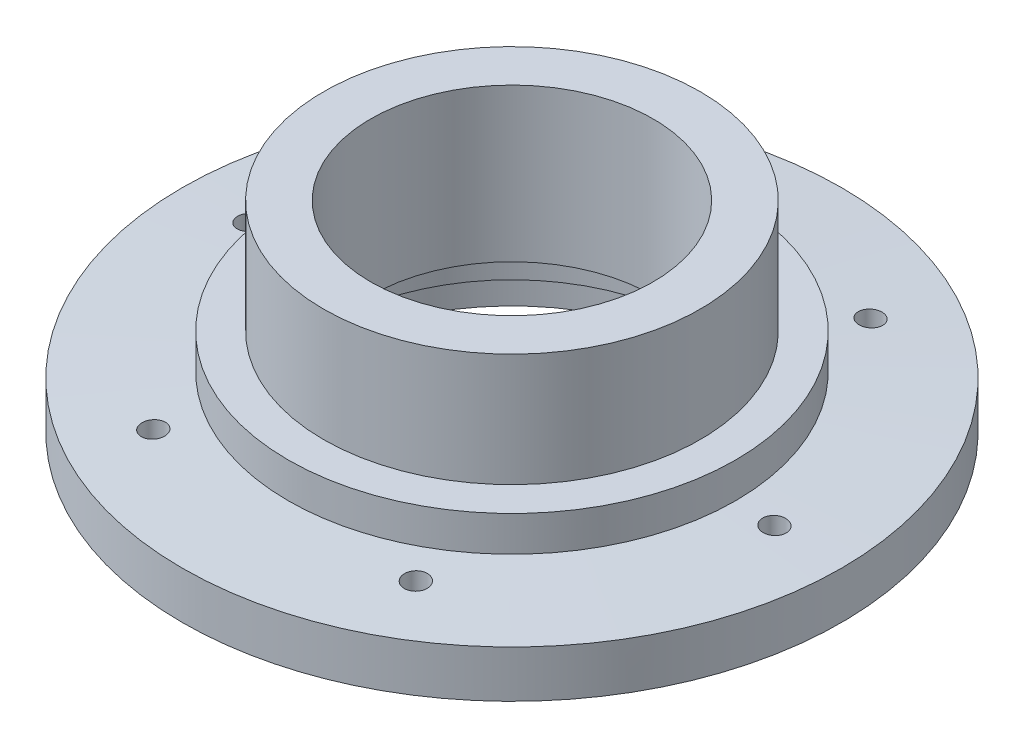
ISO-10303-21;
HEADER;
FILE_DESCRIPTION(('STEP AP214'),'2;1');
FILE_NAME('part.step','',(''),(''),'','','');
FILE_SCHEMA(('AUTOMOTIVE_DESIGN { 1 0 10303 214 1 1 1 1 }'));
ENDSEC;
DATA;
#1=APPLICATION_CONTEXT('core data for automotive mechanical design processes');
#2=APPLICATION_PROTOCOL_DEFINITION('international standard','automotive_design',2000,#1);
#3=PRODUCT_CONTEXT('',#1,'mechanical');
#4=PRODUCT('Part','Part','',(#3));
#5=PRODUCT_RELATED_PRODUCT_CATEGORY('part','',(#4));
#6=PRODUCT_DEFINITION_FORMATION('','',#4);
#7=PRODUCT_DEFINITION_CONTEXT('part definition',#1,'design');
#8=PRODUCT_DEFINITION('design','',#6,#7);
#9=PRODUCT_DEFINITION_SHAPE('','',#8);
#10=(LENGTH_UNIT() NAMED_UNIT(*) SI_UNIT(.MILLI.,.METRE.));
#11=(NAMED_UNIT(*) PLANE_ANGLE_UNIT() SI_UNIT($,.RADIAN.));
#12=(NAMED_UNIT(*) SI_UNIT($,.STERADIAN.) SOLID_ANGLE_UNIT());
#13=UNCERTAINTY_MEASURE_WITH_UNIT(LENGTH_MEASURE(1.E-05),#10,'distance_accuracy_value','');
#14=(GEOMETRIC_REPRESENTATION_CONTEXT(3) GLOBAL_UNCERTAINTY_ASSIGNED_CONTEXT((#13)) GLOBAL_UNIT_ASSIGNED_CONTEXT((#10,
#11,#12)) REPRESENTATION_CONTEXT('',''));
#15=CARTESIAN_POINT('',(0.,0.,0.));
#16=DIRECTION('',(0.,0.,1.));
#17=DIRECTION('',(1.,0.,0.));
#18=AXIS2_PLACEMENT_3D('',#15,#16,#17);
#19=CARTESIAN_POINT('',(0.,10.,6.));
#20=DIRECTION('',(0.,1.,0.));
#21=DIRECTION('',(0.,0.,1.));
#22=AXIS2_PLACEMENT_3D('',#19,#20,#21);
#23=PLANE('',#22);
#24=CARTESIAN_POINT('',(0.,10.,0.));
#25=DIRECTION('',(0.,1.,0.));
#26=DIRECTION('',(0.,0.,1.));
#27=AXIS2_PLACEMENT_3D('',#24,#25,#26);
#28=CIRCLE('',#27,6.);
#29=CARTESIAN_POINT('',(0.,10.,6.));
#30=VERTEX_POINT('',#29);
#31=EDGE_CURVE('E16',#30,#30,#28,.F.);
#32=ORIENTED_EDGE('',*,*,#31,.T.);
#33=EDGE_LOOP('',(#32));
#34=FACE_BOUND('',#33,.T.);
#35=CARTESIAN_POINT('',(0.,10.,0.));
#36=DIRECTION('',(0.,1.,0.));
#37=DIRECTION('',(0.,0.,1.));
#38=AXIS2_PLACEMENT_3D('',#35,#36,#37);
#39=CIRCLE('',#38,8.);
#40=CARTESIAN_POINT('',(0.,10.,8.));
#41=VERTEX_POINT('',#40);
#42=EDGE_CURVE('E199',#41,#41,#39,.F.);
#43=ORIENTED_EDGE('',*,*,#42,.F.);
#44=EDGE_LOOP('',(#43));
#45=FACE_BOUND('',#44,.T.);
#46=ADVANCED_FACE('F13',(#34,#45),#23,.T.);
#47=CARTESIAN_POINT('',(0.,5.00000000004,0.));
#48=DIRECTION('',(0.,1.,0.));
#49=DIRECTION('',(0.,0.,1.));
#50=AXIS2_PLACEMENT_3D('',#47,#48,#49);
#51=CYLINDRICAL_SURFACE('',#50,6.);
#52=ORIENTED_EDGE('',*,*,#31,.F.);
#53=EDGE_LOOP('',(#52));
#54=FACE_BOUND('',#53,.T.);
#55=CARTESIAN_POINT('',(0.,3.5,0.));
#56=DIRECTION('',(0.,1.,0.));
#57=DIRECTION('',(0.,0.,1.));
#58=AXIS2_PLACEMENT_3D('',#55,#56,#57);
#59=CIRCLE('',#58,6.);
#60=CARTESIAN_POINT('',(0.,3.5,6.));
#61=VERTEX_POINT('',#60);
#62=EDGE_CURVE('E197',#61,#61,#59,.F.);
#63=ORIENTED_EDGE('',*,*,#62,.T.);
#64=EDGE_LOOP('',(#63));
#65=FACE_BOUND('',#64,.T.);
#66=ADVANCED_FACE('F208',(#54,#65),#51,.F.);
#67=CARTESIAN_POINT('',(0.,5.00000000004,0.));
#68=DIRECTION('',(0.,1.,0.));
#69=DIRECTION('',(0.,0.,1.));
#70=AXIS2_PLACEMENT_3D('',#67,#68,#69);
#71=CYLINDRICAL_SURFACE('',#70,8.);
#72=CARTESIAN_POINT('',(0.,5.2,0.));
#73=DIRECTION('',(0.,1.,0.));
#74=DIRECTION('',(0.,0.,1.));
#75=AXIS2_PLACEMENT_3D('',#72,#73,#74);
#76=CIRCLE('',#75,8.);
#77=CARTESIAN_POINT('',(0.,5.2,8.));
#78=VERTEX_POINT('',#77);
#79=EDGE_CURVE('E194',#78,#78,#76,.F.);
#80=ORIENTED_EDGE('',*,*,#79,.F.);
#81=EDGE_LOOP('',(#80));
#82=FACE_BOUND('',#81,.T.);
#83=ORIENTED_EDGE('',*,*,#42,.T.);
#84=EDGE_LOOP('',(#83));
#85=FACE_BOUND('',#84,.T.);
#86=ADVANCED_FACE('F211',(#82,#85),#71,.T.);
#87=CARTESIAN_POINT('',(0.,3.5,7.75));
#88=DIRECTION('',(0.,1.,0.));
#89=DIRECTION('',(0.,0.,1.));
#90=AXIS2_PLACEMENT_3D('',#87,#88,#89);
#91=PLANE('',#90);
#92=ORIENTED_EDGE('',*,*,#62,.F.);
#93=EDGE_LOOP('',(#92));
#94=FACE_BOUND('',#93,.T.);
#95=CARTESIAN_POINT('',(0.,3.5,0.));
#96=DIRECTION('',(0.,1.,0.));
#97=DIRECTION('',(0.,0.,1.));
#98=AXIS2_PLACEMENT_3D('',#95,#96,#97);
#99=CIRCLE('',#98,7.75);
#100=CARTESIAN_POINT('',(0.,3.5,7.75));
#101=VERTEX_POINT('',#100);
#102=EDGE_CURVE('E189',#101,#101,#99,.F.);
#103=ORIENTED_EDGE('',*,*,#102,.T.);
#104=EDGE_LOOP('',(#103));
#105=FACE_BOUND('',#104,.T.);
#106=ADVANCED_FACE('F214',(#94,#105),#91,.F.);
#107=CARTESIAN_POINT('',(0.,5.2,9.5));
#108=DIRECTION('',(0.,1.,0.));
#109=DIRECTION('',(0.,0.,1.));
#110=AXIS2_PLACEMENT_3D('',#107,#108,#109);
#111=PLANE('',#110);
#112=ORIENTED_EDGE('',*,*,#79,.T.);
#113=EDGE_LOOP('',(#112));
#114=FACE_BOUND('',#113,.T.);
#115=CARTESIAN_POINT('',(0.,5.2,0.));
#116=DIRECTION('',(0.,1.,0.));
#117=DIRECTION('',(0.,0.,1.));
#118=AXIS2_PLACEMENT_3D('',#115,#116,#117);
#119=CIRCLE('',#118,9.5);
#120=CARTESIAN_POINT('',(0.,5.2,9.5));
#121=VERTEX_POINT('',#120);
#122=EDGE_CURVE('E185',#121,#121,#119,.F.);
#123=ORIENTED_EDGE('',*,*,#122,.F.);
#124=EDGE_LOOP('',(#123));
#125=FACE_BOUND('',#124,.T.);
#126=ADVANCED_FACE('F217',(#114,#125),#111,.T.);
#127=CARTESIAN_POINT('',(0.,5.00000000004,0.));
#128=DIRECTION('',(0.,1.,0.));
#129=DIRECTION('',(0.,0.,1.));
#130=AXIS2_PLACEMENT_3D('',#127,#128,#129);
#131=CYLINDRICAL_SURFACE('',#130,7.75);
#132=ORIENTED_EDGE('',*,*,#102,.F.);
#133=EDGE_LOOP('',(#132));
#134=FACE_BOUND('',#133,.T.);
#135=CARTESIAN_POINT('',(0.,1.6,0.));
#136=DIRECTION('',(0.,1.,0.));
#137=DIRECTION('',(0.,0.,1.));
#138=AXIS2_PLACEMENT_3D('',#135,#136,#137);
#139=CIRCLE('',#138,7.75);
#140=CARTESIAN_POINT('',(0.,1.6,7.75));
#141=VERTEX_POINT('',#140);
#142=EDGE_CURVE('E181',#141,#141,#139,.F.);
#143=ORIENTED_EDGE('',*,*,#142,.T.);
#144=EDGE_LOOP('',(#143));
#145=FACE_BOUND('',#144,.T.);
#146=ADVANCED_FACE('F221',(#134,#145),#131,.F.);
#147=CARTESIAN_POINT('',(0.,5.00000000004,0.));
#148=DIRECTION('',(0.,1.,0.));
#149=DIRECTION('',(0.,0.,1.));
#150=AXIS2_PLACEMENT_3D('',#147,#148,#149);
#151=CYLINDRICAL_SURFACE('',#150,9.5);
#152=CARTESIAN_POINT('',(0.,3.69999999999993,0.));
#153=DIRECTION('',(0.,-1.,0.));
#154=DIRECTION('',(0.479425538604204,0.,0.877582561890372));
#155=AXIS2_PLACEMENT_3D('',#152,#153,#154);
#156=CIRCLE('',#155,9.50000000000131);
#157=CARTESIAN_POINT('',(4.55454261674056,3.69999999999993,8.33703433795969));
#158=VERTEX_POINT('',#157);
#159=EDGE_CURVE('E32',#158,#158,#156,.T.);
#160=ORIENTED_EDGE('',*,*,#159,.F.);
#161=EDGE_LOOP('',(#160));
#162=FACE_BOUND('',#161,.T.);
#163=ORIENTED_EDGE('',*,*,#122,.T.);
#164=EDGE_LOOP('',(#163));
#165=FACE_BOUND('',#164,.T.);
#166=ADVANCED_FACE('F223',(#162,#165),#151,.T.);
#167=CARTESIAN_POINT('',(0.,1.6,8.65));
#168=DIRECTION('',(0.,1.,0.));
#169=DIRECTION('',(0.,0.,1.));
#170=AXIS2_PLACEMENT_3D('',#167,#168,#169);
#171=PLANE('',#170);
#172=ORIENTED_EDGE('',*,*,#142,.F.);
#173=EDGE_LOOP('',(#172));
#174=FACE_BOUND('',#173,.T.);
#175=CARTESIAN_POINT('',(0.,1.6,0.));
#176=DIRECTION('',(0.,1.,0.));
#177=DIRECTION('',(0.,0.,1.));
#178=AXIS2_PLACEMENT_3D('',#175,#176,#177);
#179=CIRCLE('',#178,8.65);
#180=CARTESIAN_POINT('',(0.,1.6,8.65));
#181=VERTEX_POINT('',#180);
#182=EDGE_CURVE('E73',#181,#181,#179,.F.);
#183=ORIENTED_EDGE('',*,*,#182,.T.);
#184=EDGE_LOOP('',(#183));
#185=FACE_BOUND('',#184,.T.);
#186=ADVANCED_FACE('F80',(#174,#185),#171,.F.);
#187=CARTESIAN_POINT('',(-5.575,3.,-9.6561832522));
#188=DIRECTION('',(0.,1.,0.));
#189=DIRECTION('',(0.,0.,1.));
#190=AXIS2_PLACEMENT_3D('',#187,#188,#189);
#191=CYLINDRICAL_SURFACE('',#190,0.5);
#192=CARTESIAN_POINT('',(-5.14026455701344,3.63783106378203,-9.40919115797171));
#193=CARTESIAN_POINT('',(-5.15414269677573,3.6385833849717,-9.38476288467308));
#194=CARTESIAN_POINT('',(-5.17008437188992,3.63922892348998,-9.36150687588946));
#195=CARTESIAN_POINT('',(-5.20563237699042,3.64028501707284,-9.31802042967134));
#196=CARTESIAN_POINT('',(-5.22523340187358,3.64069590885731,-9.29778568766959));
#197=CARTESIAN_POINT('',(-5.25853320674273,3.64114843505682,-9.26874309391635));
#198=CARTESIAN_POINT('',(-5.27120246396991,3.64127278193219,-9.25873239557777));
#199=CARTESIAN_POINT('',(-5.29744842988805,3.64143881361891,-9.23997987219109));
#200=CARTESIAN_POINT('',(-5.31102515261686,3.64148049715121,-9.23123806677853));
#201=CARTESIAN_POINT('',(-5.34929470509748,3.64148037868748,-9.20914550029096));
#202=CARTESIAN_POINT('',(-5.37479263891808,3.64135419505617,-9.19715831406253));
#203=CARTESIAN_POINT('',(-5.42745959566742,3.64085307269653,-9.17762006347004));
#204=CARTESIAN_POINT('',(-5.45463083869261,3.64047779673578,-9.17007503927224));
#205=CARTESIAN_POINT('',(-5.50983709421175,3.63949079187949,-9.15965325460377));
#206=CARTESIAN_POINT('',(-5.53787160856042,3.63887919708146,-9.15677385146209));
#207=CARTESIAN_POINT('',(-5.59401214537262,3.63743949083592,-9.15575676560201));
#208=CARTESIAN_POINT('',(-5.62211814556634,3.63661144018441,-9.15761775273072));
#209=CARTESIAN_POINT('',(-5.67763602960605,3.63476439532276,-9.16602549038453));
#210=CARTESIAN_POINT('',(-5.70504736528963,3.63374525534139,-9.17257582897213));
#211=CARTESIAN_POINT('',(-5.75837898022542,3.63154829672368,-9.19017816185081));
#212=CARTESIAN_POINT('',(-5.7842991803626,3.63037046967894,-9.20123039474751));
#213=CARTESIAN_POINT('',(-5.83394755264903,3.62789065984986,-9.22753835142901));
#214=CARTESIAN_POINT('',(-5.85767282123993,3.62658851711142,-9.24279953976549));
#215=CARTESIAN_POINT('',(-5.90222224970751,3.62390049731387,-9.27708478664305));
#216=CARTESIAN_POINT('',(-5.92304640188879,3.62251462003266,-9.29610885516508));
#217=CARTESIAN_POINT('',(-5.96122746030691,3.61969815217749,-9.33740428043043));
#218=CARTESIAN_POINT('',(-5.97858032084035,3.61826751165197,-9.35967937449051));
#219=CARTESIAN_POINT('',(-6.00929687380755,3.61540414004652,-9.40682835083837));
#220=CARTESIAN_POINT('',(-6.02266055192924,3.61397140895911,-9.43170224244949));
#221=CARTESIAN_POINT('',(-6.04502465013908,3.6111434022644,-9.48335598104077));
#222=CARTESIAN_POINT('',(-6.05402298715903,3.60974814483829,-9.51013673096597));
#223=CARTESIAN_POINT('',(-6.06738998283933,3.60703416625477,-9.56483381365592));
#224=CARTESIAN_POINT('',(-6.0717585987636,3.60571544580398,-9.59275015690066));
#225=CARTESIAN_POINT('',(-6.07573900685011,3.60319053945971,-9.64891608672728));
#226=CARTESIAN_POINT('',(-6.07535231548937,3.60198431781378,-9.67716556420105));
#227=CARTESIAN_POINT('',(-6.06983411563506,3.59971601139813,-9.73320077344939));
#228=CARTESIAN_POINT('',(-6.06470303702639,3.59865391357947,-9.76098654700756));
#229=CARTESIAN_POINT('',(-6.04984893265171,3.59670263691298,-9.81527292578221));
#230=CARTESIAN_POINT('',(-6.04013137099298,3.595813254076,-9.84177501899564));
#231=CARTESIAN_POINT('',(-6.0163731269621,3.5942283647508,-9.89278764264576));
#232=CARTESIAN_POINT('',(-6.00233040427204,3.59353295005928,-9.91729722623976));
#233=CARTESIAN_POINT('',(-5.97033073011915,3.59235451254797,-9.96360129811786));
#234=CARTESIAN_POINT('',(-5.95237510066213,3.59187141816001,-9.98539669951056));
#235=CARTESIAN_POINT('',(-5.91308472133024,3.5911303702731,-10.0256236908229));
#236=CARTESIAN_POINT('',(-5.89175743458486,3.59087192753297,-10.0440625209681));
#237=CARTESIAN_POINT('',(-5.8548849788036,3.59063870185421,-10.0708794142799));
#238=CARTESIAN_POINT('',(-5.8401772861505,3.59059383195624,-10.0804348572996));
#239=CARTESIAN_POINT('',(-5.80070039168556,3.59059398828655,-10.1032229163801));
#240=CARTESIAN_POINT('',(-5.77519704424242,3.59070925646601,-10.1152136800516));
#241=CARTESIAN_POINT('',(-5.72251299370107,3.59116824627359,-10.1347549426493));
#242=CARTESIAN_POINT('',(-5.69533020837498,3.59151225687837,-10.1422998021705));
#243=CARTESIAN_POINT('',(-5.64800473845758,3.59228975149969,-10.1512321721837));
#244=CARTESIAN_POINT('',(-5.62807014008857,3.59266957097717,-10.1537631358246));
#245=CARTESIAN_POINT('',(-5.58805340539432,3.59353585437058,-10.1564148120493));
#246=CARTESIAN_POINT('',(-5.56797134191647,3.59402226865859,-10.1565366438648));
#247=CARTESIAN_POINT('',(-5.51988755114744,3.59531176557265,-10.153929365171));
#248=CARTESIAN_POINT('',(-5.49194254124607,3.59616358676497,-10.1500362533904));
#249=CARTESIAN_POINT('',(-5.43708807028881,3.59804408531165,-10.1376109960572));
#250=CARTESIAN_POINT('',(-5.41017970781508,3.59907294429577,-10.129074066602));
#251=CARTESIAN_POINT('',(-5.35819434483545,3.60127986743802,-10.1076092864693));
#252=CARTESIAN_POINT('',(-5.33311650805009,3.60245786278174,-10.0946834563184));
#253=CARTESIAN_POINT('',(-5.28549603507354,3.60493207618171,-10.0648119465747));
#254=CARTESIAN_POINT('',(-5.26295289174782,3.60622827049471,-10.0478670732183));
#255=CARTESIAN_POINT('',(-5.22101241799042,3.60890565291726,-10.0104201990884));
#256=CARTESIAN_POINT('',(-5.2016180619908,3.6102869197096,-9.98991487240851));
#257=CARTESIAN_POINT('',(-5.16654903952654,3.6130956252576,-9.9459396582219));
#258=CARTESIAN_POINT('',(-5.15087451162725,3.614523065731,-9.92246966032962));
#259=CARTESIAN_POINT('',(-5.12367840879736,3.61738539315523,-9.87321083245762));
#260=CARTESIAN_POINT('',(-5.11216023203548,3.61882028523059,-9.84742012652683));
#261=CARTESIAN_POINT('',(-5.09362206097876,3.62165529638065,-9.79426829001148));
#262=CARTESIAN_POINT('',(-5.08660202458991,3.62305541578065,-9.76690717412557));
#263=CARTESIAN_POINT('',(-5.07726022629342,3.62578001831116,-9.71138804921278));
#264=CARTESIAN_POINT('',(-5.07493885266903,3.62710449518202,-9.68322997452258));
#265=CARTESIAN_POINT('',(-5.07506360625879,3.62963796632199,-9.62691890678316));
#266=CARTESIAN_POINT('',(-5.07750985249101,3.63084695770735,-9.59876591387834));
#267=CARTESIAN_POINT('',(-5.08720933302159,3.63313723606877,-9.54265587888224));
#268=CARTESIAN_POINT('',(-5.09456674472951,3.6342151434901,-9.51471665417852));
#269=CARTESIAN_POINT('',(-5.11398066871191,3.63617649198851,-9.46050444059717));
#270=CARTESIAN_POINT('',(-5.12603845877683,3.63705988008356,-9.43423190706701));
#271=CARTESIAN_POINT('',(-5.14026455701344,3.63783106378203,-9.40919115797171));
#272=B_SPLINE_CURVE_WITH_KNOTS('',3,(#192,#193,#194,#195,#196,#197,#198,#199,#200,#201,#202,
#203,#204,#205,#206,#207,#208,#209,#210,#211,#212,#213,#214,#215,#216,#217,#218,#219,#220,#221,
#222,#223,#224,#225,#226,#227,#228,#229,#230,#231,#232,#233,#234,#235,#236,#237,#238,#239,#240,
#241,#242,#243,#244,#245,#246,#247,#248,#249,#250,#251,#252,#253,#254,#255,#256,#257,#258,#259,
#260,#261,#262,#263,#264,#265,#266,#267,#268,#269,#270,#271),.UNSPECIFIED.,.T.,.F.,(4,2,2,2,2,2,
2,2,2,2,2,2,2,2,2,2,2,2,2,2,2,2,2,2,2,2,2,2,2,2,2,2,2,2,2,2,2,2,2,4),(0.,0.0842166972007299,
0.168312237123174,0.216686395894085,0.265061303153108,0.349159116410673,0.433371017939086,
0.517535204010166,0.60167577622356,0.685880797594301,0.770090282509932,0.854409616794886,
0.938729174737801,1.02314643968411,1.10756400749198,1.19202181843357,1.27648040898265,
1.36091206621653,1.44533607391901,1.52965975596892,1.61402327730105,1.6983583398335,
1.78250927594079,1.8350491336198,1.91916812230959,2.00339358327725,2.06354926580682,
2.12367700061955,2.20794007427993,2.2922901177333,2.37660138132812,2.4608957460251,
2.54526927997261,2.62964595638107,2.71409146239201,2.79853617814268,2.88298787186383,
2.9674416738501,3.05374640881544,3.14007462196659),.UNSPECIFIED.);
#273=CARTESIAN_POINT('',(-5.14026455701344,3.63783106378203,-9.40919115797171));
#274=VERTEX_POINT('',#273);
#275=EDGE_CURVE('E85',#274,#274,#272,.T.);
#276=ORIENTED_EDGE('',*,*,#275,.F.);
#277=EDGE_LOOP('',(#276));
#278=FACE_BOUND('',#277,.T.);
#279=CARTESIAN_POINT('',(-5.32500000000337,0.549910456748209,-9.22317055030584));
#280=CARTESIAN_POINT('',(-5.30136781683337,0.549911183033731,-9.23681734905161));
#281=CARTESIAN_POINT('',(-5.27883219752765,0.550556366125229,-9.25241557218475));
#282=CARTESIAN_POINT('',(-5.23663366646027,0.55311673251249,-9.28705609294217));
#283=CARTESIAN_POINT('',(-5.21697397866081,0.555033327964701,-9.30610220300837));
#284=CARTESIAN_POINT('',(-5.18783725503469,0.559113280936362,-9.33933290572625));
#285=CARTESIAN_POINT('',(-5.17730932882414,0.560913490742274,-9.35265610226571));
#286=CARTESIAN_POINT('',(-5.15769109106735,0.564950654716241,-9.38024885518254));
#287=CARTESIAN_POINT('',(-5.14860006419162,0.567187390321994,-9.394517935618));
#288=CARTESIAN_POINT('',(-5.12624083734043,0.573737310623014,-9.43387749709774));
#289=CARTESIAN_POINT('',(-5.11435561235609,0.578425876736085,-9.45970775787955));
#290=CARTESIAN_POINT('',(-5.09514853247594,0.588791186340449,-9.51285357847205));
#291=CARTESIAN_POINT('',(-5.0878338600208,0.594469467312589,-9.54017140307));
#292=CARTESIAN_POINT('',(-5.07791509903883,0.606604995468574,-9.59541870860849));
#293=CARTESIAN_POINT('',(-5.07530142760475,0.613060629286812,-9.62334682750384));
#294=CARTESIAN_POINT('',(-5.07474782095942,0.626556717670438,-9.67909523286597));
#295=CARTESIAN_POINT('',(-5.0768067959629,0.633597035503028,-9.70691554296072));
#296=CARTESIAN_POINT('',(-5.0855998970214,0.648260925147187,-9.76248608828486));
#297=CARTESIAN_POINT('',(-5.09246072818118,0.655895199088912,-9.79021346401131));
#298=CARTESIAN_POINT('',(-5.11076717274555,0.671353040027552,-9.84405767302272));
#299=CARTESIAN_POINT('',(-5.12221361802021,0.679176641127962,-9.87017421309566));
#300=CARTESIAN_POINT('',(-5.14967890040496,0.694975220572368,-9.92065613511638));
#301=CARTESIAN_POINT('',(-5.16579453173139,0.702949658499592,-9.94496910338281));
#302=CARTESIAN_POINT('',(-5.20204989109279,0.718651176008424,-9.99048058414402));
#303=CARTESIAN_POINT('',(-5.22219001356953,0.726378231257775,-10.0116787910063));
#304=CARTESIAN_POINT('',(-5.26594354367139,0.741364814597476,-10.0503094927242));
#305=CARTESIAN_POINT('',(-5.28955565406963,0.74862451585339,-10.0677433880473));
#306=CARTESIAN_POINT('',(-5.33960520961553,0.762468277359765,-10.098277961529));
#307=CARTESIAN_POINT('',(-5.36604143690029,0.769052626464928,-10.1113804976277));
#308=CARTESIAN_POINT('',(-5.41801437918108,0.780685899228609,-10.1316281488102));
#309=CARTESIAN_POINT('',(-5.44334150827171,0.785823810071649,-10.139262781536));
#310=CARTESIAN_POINT('',(-5.4950336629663,0.795277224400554,-10.1504546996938));
#311=CARTESIAN_POINT('',(-5.52139861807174,0.799592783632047,-10.1540122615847));
#312=CARTESIAN_POINT('',(-5.57510834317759,0.807375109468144,-10.1569226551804));
#313=CARTESIAN_POINT('',(-5.6024617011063,0.810820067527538,-10.1561768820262));
#314=CARTESIAN_POINT('',(-5.65678145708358,0.816626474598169,-10.1502046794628));
#315=CARTESIAN_POINT('',(-5.68374811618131,0.818988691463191,-10.1449814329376));
#316=CARTESIAN_POINT('',(-5.73015863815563,0.82213068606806,-10.131955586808));
#317=CARTESIAN_POINT('',(-5.74985052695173,0.823154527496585,-10.1250767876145));
#318=CARTESIAN_POINT('',(-5.788244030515,0.824522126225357,-10.1089092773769));
#319=CARTESIAN_POINT('',(-5.80694564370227,0.824865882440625,-10.0996205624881));
#320=CARTESIAN_POINT('',(-5.84873236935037,0.824865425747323,-10.0754928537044));
#321=CARTESIAN_POINT('',(-5.87134634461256,0.824270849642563,-10.0598270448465));
#322=CARTESIAN_POINT('',(-5.91367829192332,0.821909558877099,-10.0250313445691));
#323=CARTESIAN_POINT('',(-5.93339403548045,0.820141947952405,-10.0058988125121));
#324=CARTESIAN_POINT('',(-5.96936160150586,0.815490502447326,-9.96476773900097));
#325=CARTESIAN_POINT('',(-5.98561676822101,0.812607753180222,-9.94277199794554));
#326=CARTESIAN_POINT('',(-6.01427499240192,0.805811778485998,-9.89655180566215));
#327=CARTESIAN_POINT('',(-6.02667841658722,0.801898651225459,-9.87232756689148));
#328=CARTESIAN_POINT('',(-6.0475048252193,0.793091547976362,-9.82198851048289));
#329=CARTESIAN_POINT('',(-6.05587004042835,0.788184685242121,-9.79585208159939));
#330=CARTESIAN_POINT('',(-6.06820892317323,0.77756080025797,-9.74272267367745));
#331=CARTESIAN_POINT('',(-6.07218192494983,0.77184365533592,-9.71572956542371));
#332=CARTESIAN_POINT('',(-6.0757606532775,0.759559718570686,-9.66075654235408));
#333=CARTESIAN_POINT('',(-6.07522582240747,0.752971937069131,-9.6327721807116));
#334=CARTESIAN_POINT('',(-6.06953951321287,0.739269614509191,-9.5774085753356));
#335=CARTESIAN_POINT('',(-6.06438725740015,0.732154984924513,-9.5500294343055));
#336=CARTESIAN_POINT('',(-6.04941951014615,0.717349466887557,-9.49573383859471));
#337=CARTESIAN_POINT('',(-6.03946079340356,0.709647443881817,-9.46885985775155));
#338=CARTESIAN_POINT('',(-6.01513486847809,0.694084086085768,-9.41723597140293));
#339=CARTESIAN_POINT('',(-6.00076706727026,0.686222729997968,-9.392486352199));
#340=CARTESIAN_POINT('',(-5.96769755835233,0.670399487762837,-9.3453229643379));
#341=CARTESIAN_POINT('',(-5.94891655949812,0.662438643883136,-9.32296436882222));
#342=CARTESIAN_POINT('',(-5.90769424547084,0.646802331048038,-9.28179972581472));
#343=CARTESIAN_POINT('',(-5.88525277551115,0.639126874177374,-9.26299382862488));
#344=CARTESIAN_POINT('',(-5.83737370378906,0.624313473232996,-9.22955628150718));
#345=CARTESIAN_POINT('',(-5.81194333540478,0.617174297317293,-9.2149148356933));
#346=CARTESIAN_POINT('',(-5.75874988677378,0.603648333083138,-9.19024870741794));
#347=CARTESIAN_POINT('',(-5.73098728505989,0.597261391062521,-9.18022308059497));
#348=CARTESIAN_POINT('',(-5.67467142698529,0.585619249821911,-9.16537603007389));
#349=CARTESIAN_POINT('',(-5.64615699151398,0.580339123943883,-9.16042713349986));
#350=CARTESIAN_POINT('',(-5.58850208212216,0.570902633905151,-9.15552939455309));
#351=CARTESIAN_POINT('',(-5.55936144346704,0.566746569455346,-9.15558188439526));
#352=CARTESIAN_POINT('',(-5.5024599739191,0.559858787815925,-9.16067938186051));
#353=CARTESIAN_POINT('',(-5.47468808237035,0.557079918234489,-9.16553896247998));
#354=CARTESIAN_POINT('',(-5.42031507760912,0.552837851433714,-9.1798856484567));
#355=CARTESIAN_POINT('',(-5.39371120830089,0.551371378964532,-9.18936114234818));
#356=CARTESIAN_POINT('',(-5.35338749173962,0.55013581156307,-9.20768497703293));
#357=CARTESIAN_POINT('',(-5.33900128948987,0.54991002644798,-9.21508527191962));
#358=CARTESIAN_POINT('',(-5.32500000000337,0.549910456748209,-9.22317055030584));
#359=B_SPLINE_CURVE_WITH_KNOTS('',3,(#279,#280,#281,#282,#283,#284,#285,#286,#287,#288,#289,
#290,#291,#292,#293,#294,#295,#296,#297,#298,#299,#300,#301,#302,#303,#304,#305,#306,#307,#308,
#309,#310,#311,#312,#313,#314,#315,#316,#317,#318,#319,#320,#321,#322,#323,#324,#325,#326,#327,
#328,#329,#330,#331,#332,#333,#334,#335,#336,#337,#338,#339,#340,#341,#342,#343,#344,#345,#346,
#347,#348,#349,#350,#351,#352,#353,#354,#355,#356,#357,#358),.UNSPECIFIED.,.T.,.F.,(4,2,2,2,2,2,
2,2,2,2,2,2,2,2,2,2,2,2,2,2,2,2,2,2,2,2,2,2,2,2,2,2,2,2,2,2,2,2,2,4),(0.,0.081819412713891,
0.163729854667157,0.214870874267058,0.265986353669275,0.35198341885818,0.438115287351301,
0.524071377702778,0.610007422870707,0.698300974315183,0.786610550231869,0.876900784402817,
0.967199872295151,1.05746530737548,1.14769197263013,1.22820457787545,1.30871172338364,
1.39107079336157,1.47337136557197,1.53585680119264,1.59834233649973,1.68047928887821,
1.76267907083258,1.84479905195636,1.92691121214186,2.01016557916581,2.09343256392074,
2.17930525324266,2.26519240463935,2.35381363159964,2.4424467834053,2.53281399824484,
2.62318503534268,2.71334170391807,2.80347991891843,2.89129491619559,2.97913330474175,
3.06371056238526,3.14807615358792,3.1965514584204),.UNSPECIFIED.);
#360=CARTESIAN_POINT('',(-5.32500000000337,0.549910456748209,-9.22317055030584));
#361=VERTEX_POINT('',#360);
#362=EDGE_CURVE('E66',#361,#361,#359,.T.);
#363=ORIENTED_EDGE('',*,*,#362,.F.);
#364=EDGE_LOOP('',(#363));
#365=FACE_BOUND('',#364,.T.);
#366=ADVANCED_FACE('F75',(#278,#365),#191,.F.);
#367=CARTESIAN_POINT('',(5.575,3.,9.6561832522));
#368=DIRECTION('',(0.,1.,0.));
#369=DIRECTION('',(0.,0.,1.));
#370=AXIS2_PLACEMENT_3D('',#367,#368,#369);
#371=CYLINDRICAL_SURFACE('',#370,0.5);
#372=CARTESIAN_POINT('',(5.82499999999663,3.59059389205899,10.0891959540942));
#373=CARTESIAN_POINT('',(5.80070039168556,3.59059398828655,10.1032229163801));
#374=CARTESIAN_POINT('',(5.77519704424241,3.59070925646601,10.1152136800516));
#375=CARTESIAN_POINT('',(5.72251299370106,3.59116824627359,10.1347549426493));
#376=CARTESIAN_POINT('',(5.69533020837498,3.59151225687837,10.1422998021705));
#377=CARTESIAN_POINT('',(5.64800473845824,3.59228975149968,10.1512321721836));
#378=CARTESIAN_POINT('',(5.6280701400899,3.59266957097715,10.1537631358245));
#379=CARTESIAN_POINT('',(5.588053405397,3.59353585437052,10.1564148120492));
#380=CARTESIAN_POINT('',(5.56797134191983,3.59402226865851,10.1565366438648));
#381=CARTESIAN_POINT('',(5.51988755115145,3.59531176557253,10.1539293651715));
#382=CARTESIAN_POINT('',(5.49194254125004,3.59616358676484,10.150036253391));
#383=CARTESIAN_POINT('',(5.43708807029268,3.59804408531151,10.1376109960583));
#384=CARTESIAN_POINT('',(5.41017970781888,3.59907294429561,10.1290740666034));
#385=CARTESIAN_POINT('',(5.35819434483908,3.60127986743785,10.107609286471));
#386=CARTESIAN_POINT('',(5.33311650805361,3.60245786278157,10.0946834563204));
#387=CARTESIAN_POINT('',(5.28549603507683,3.60493207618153,10.0648119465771));
#388=CARTESIAN_POINT('',(5.26295289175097,3.60622827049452,10.0478670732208));
#389=CARTESIAN_POINT('',(5.22101241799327,3.60890565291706,10.0104201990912));
#390=CARTESIAN_POINT('',(5.20161806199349,3.6102869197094,9.98991487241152));
#391=CARTESIAN_POINT('',(5.16654903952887,3.6130956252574,9.94593965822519));
#392=CARTESIAN_POINT('',(5.1508745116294,3.6145230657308,9.92246966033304));
#393=CARTESIAN_POINT('',(5.12367840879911,3.61738539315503,9.87321083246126));
#394=CARTESIAN_POINT('',(5.11216023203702,3.61882028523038,9.84742012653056));
#395=CARTESIAN_POINT('',(5.09362206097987,3.62165529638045,9.79426829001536));
#396=CARTESIAN_POINT('',(5.0866020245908,3.62305541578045,9.7669071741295));
#397=CARTESIAN_POINT('',(5.07726022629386,3.62578001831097,9.71138804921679));
#398=CARTESIAN_POINT('',(5.07493885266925,3.62710449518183,9.68322997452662));
#399=CARTESIAN_POINT('',(5.07506360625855,3.62963796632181,9.6269189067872));
#400=CARTESIAN_POINT('',(5.07750985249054,3.63084695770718,9.59876591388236));
#401=CARTESIAN_POINT('',(5.08720933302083,3.63313723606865,9.54265587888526));
#402=CARTESIAN_POINT('',(5.09456674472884,3.63421514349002,9.51471665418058));
#403=CARTESIAN_POINT('',(5.11398066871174,3.63617649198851,9.46050444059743));
#404=CARTESIAN_POINT('',(5.12603845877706,3.63705988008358,9.43423190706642));
#405=CARTESIAN_POINT('',(5.15414269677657,3.63858338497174,9.38476288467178));
#406=CARTESIAN_POINT('',(5.17008437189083,3.63922892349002,9.36150687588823));
#407=CARTESIAN_POINT('',(5.20563237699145,3.64028501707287,9.31802042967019));
#408=CARTESIAN_POINT('',(5.22523340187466,3.64069590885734,9.29778568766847));
#409=CARTESIAN_POINT('',(5.25853320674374,3.64114843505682,9.26874309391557));
#410=CARTESIAN_POINT('',(5.27120246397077,3.64127278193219,9.25873239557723));
#411=CARTESIAN_POINT('',(5.29744842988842,3.64143881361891,9.23997987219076));
#412=CARTESIAN_POINT('',(5.31102515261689,3.64148049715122,9.23123806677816));
#413=CARTESIAN_POINT('',(5.34929470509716,3.6414803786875,9.20914550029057));
#414=CARTESIAN_POINT('',(5.37479263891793,3.64135419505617,9.19715831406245));
#415=CARTESIAN_POINT('',(5.42745959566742,3.64085307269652,9.17762006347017));
#416=CARTESIAN_POINT('',(5.45463083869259,3.64047779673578,9.17007503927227));
#417=CARTESIAN_POINT('',(5.50983709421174,3.6394907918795,9.15965325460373));
#418=CARTESIAN_POINT('',(5.53787160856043,3.63887919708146,9.15677385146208));
#419=CARTESIAN_POINT('',(5.59401214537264,3.63743949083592,9.15575676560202));
#420=CARTESIAN_POINT('',(5.62211814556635,3.63661144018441,9.15761775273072));
#421=CARTESIAN_POINT('',(5.67763602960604,3.63476439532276,9.16602549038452));
#422=CARTESIAN_POINT('',(5.70504736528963,3.63374525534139,9.17257582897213));
#423=CARTESIAN_POINT('',(5.75837898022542,3.63154829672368,9.1901781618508));
#424=CARTESIAN_POINT('',(5.7842991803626,3.63037046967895,9.20123039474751));
#425=CARTESIAN_POINT('',(5.83394755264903,3.62789065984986,9.22753835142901));
#426=CARTESIAN_POINT('',(5.85767282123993,3.62658851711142,9.24279953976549));
#427=CARTESIAN_POINT('',(5.90222224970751,3.62390049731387,9.27708478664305));
#428=CARTESIAN_POINT('',(5.92304640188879,3.62251462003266,9.29610885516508));
#429=CARTESIAN_POINT('',(5.96122746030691,3.61969815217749,9.33740428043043));
#430=CARTESIAN_POINT('',(5.97858032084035,3.61826751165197,9.3596793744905));
#431=CARTESIAN_POINT('',(6.00929687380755,3.61540414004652,9.40682835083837));
#432=CARTESIAN_POINT('',(6.02266055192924,3.61397140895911,9.43170224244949));
#433=CARTESIAN_POINT('',(6.04502465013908,3.6111434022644,9.48335598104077));
#434=CARTESIAN_POINT('',(6.05402298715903,3.60974814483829,9.51013673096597));
#435=CARTESIAN_POINT('',(6.06738998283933,3.60703416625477,9.56483381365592));
#436=CARTESIAN_POINT('',(6.0717585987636,3.60571544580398,9.59275015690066));
#437=CARTESIAN_POINT('',(6.07573900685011,3.60319053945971,9.64891608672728));
#438=CARTESIAN_POINT('',(6.07535231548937,3.60198431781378,9.67716556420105));
#439=CARTESIAN_POINT('',(6.06983411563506,3.59971601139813,9.73320077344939));
#440=CARTESIAN_POINT('',(6.06470303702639,3.59865391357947,9.76098654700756));
#441=CARTESIAN_POINT('',(6.04984893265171,3.59670263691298,9.81527292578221));
#442=CARTESIAN_POINT('',(6.04013137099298,3.595813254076,9.84177501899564));
#443=CARTESIAN_POINT('',(6.0163731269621,3.5942283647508,9.89278764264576));
#444=CARTESIAN_POINT('',(6.00233040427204,3.59353295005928,9.91729722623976));
#445=CARTESIAN_POINT('',(5.97033073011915,3.59235451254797,9.96360129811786));
#446=CARTESIAN_POINT('',(5.95237510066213,3.59187141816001,9.98539669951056));
#447=CARTESIAN_POINT('',(5.91308472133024,3.5911303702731,10.0256236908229));
#448=CARTESIAN_POINT('',(5.89175743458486,3.59087192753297,10.0440625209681));
#449=CARTESIAN_POINT('',(5.8548849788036,3.59063870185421,10.0708794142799));
#450=CARTESIAN_POINT('',(5.8401772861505,3.59059383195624,10.0804348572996));
#451=CARTESIAN_POINT('',(5.82499999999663,3.59059389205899,10.0891959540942));
#452=B_SPLINE_CURVE_WITH_KNOTS('',3,(#372,#373,#374,#375,#376,#377,#378,#379,#380,#381,#382,
#383,#384,#385,#386,#387,#388,#389,#390,#391,#392,#393,#394,#395,#396,#397,#398,#399,#400,#401,
#402,#403,#404,#405,#406,#407,#408,#409,#410,#411,#412,#413,#414,#415,#416,#417,#418,#419,#420,
#421,#422,#423,#424,#425,#426,#427,#428,#429,#430,#431,#432,#433,#434,#435,#436,#437,#438,#439,
#440,#441,#442,#443,#444,#445,#446,#447,#448,#449,#450,#451),.UNSPECIFIED.,.T.,.F.,(4,2,2,2,2,2,
2,2,2,2,2,2,2,2,2,2,2,2,2,2,2,2,2,2,2,2,2,2,2,2,2,2,2,2,2,2,2,2,2,4),(0.,0.0841189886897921,
0.168344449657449,0.228500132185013,0.28862786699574,0.372890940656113,0.45724098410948,
0.541552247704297,0.625846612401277,0.710220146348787,0.794596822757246,0.879042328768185,
0.963487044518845,1.04793873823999,1.13239254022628,1.21869727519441,1.30502548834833,
1.38924218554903,1.4733377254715,1.52171188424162,1.57008679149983,1.65418460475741,
1.73839650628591,1.82256069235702,1.90670126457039,1.99090628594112,2.07511577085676,
2.15943510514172,2.24375466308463,2.32817192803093,2.41258949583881,2.4970473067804,
2.58150589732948,2.66593755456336,2.75036156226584,2.83468524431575,2.91904876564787,
3.00338382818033,3.08753476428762,3.14007462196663),.UNSPECIFIED.);
#453=CARTESIAN_POINT('',(5.82499999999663,3.59059389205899,10.0891959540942));
#454=VERTEX_POINT('',#453);
#455=EDGE_CURVE('E91',#454,#454,#452,.T.);
#456=ORIENTED_EDGE('',*,*,#455,.F.);
#457=EDGE_LOOP('',(#456));
#458=FACE_BOUND('',#457,.T.);
#459=CARTESIAN_POINT('',(5.32500000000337,0.549910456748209,9.22317055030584));
#460=CARTESIAN_POINT('',(5.30136781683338,0.549911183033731,9.2368173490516));
#461=CARTESIAN_POINT('',(5.27883219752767,0.550556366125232,9.25241557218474));
#462=CARTESIAN_POINT('',(5.23663366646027,0.553116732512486,9.28705609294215));
#463=CARTESIAN_POINT('',(5.21697397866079,0.555033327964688,9.30610220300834));
#464=CARTESIAN_POINT('',(5.18783725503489,0.559113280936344,9.33933290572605));
#465=CARTESIAN_POINT('',(5.17730932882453,0.560913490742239,9.35265610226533));
#466=CARTESIAN_POINT('',(5.15769109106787,0.564950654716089,9.38024885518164));
#467=CARTESIAN_POINT('',(5.14860006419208,0.56718739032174,9.39451793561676));
#468=CARTESIAN_POINT('',(5.12624083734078,0.573737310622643,9.43387749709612));
#469=CARTESIAN_POINT('',(5.11435561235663,0.578425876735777,9.45970775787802));
#470=CARTESIAN_POINT('',(5.0951485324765,0.588791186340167,9.51285357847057));
#471=CARTESIAN_POINT('',(5.0878338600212,0.594469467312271,9.54017140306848));
#472=CARTESIAN_POINT('',(5.077915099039,0.606604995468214,9.59541870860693));
#473=CARTESIAN_POINT('',(5.07530142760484,0.613060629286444,9.62334682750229));
#474=CARTESIAN_POINT('',(5.07474782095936,0.626556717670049,9.67909523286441));
#475=CARTESIAN_POINT('',(5.07680679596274,0.633597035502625,9.70691554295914));
#476=CARTESIAN_POINT('',(5.08559989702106,0.64826092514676,9.76248608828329));
#477=CARTESIAN_POINT('',(5.09246072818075,0.655895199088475,9.79021346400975));
#478=CARTESIAN_POINT('',(5.11076717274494,0.671353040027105,9.84405767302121));
#479=CARTESIAN_POINT('',(5.12221361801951,0.679176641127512,9.87017421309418));
#480=CARTESIAN_POINT('',(5.14967890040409,0.694975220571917,9.92065613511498));
#481=CARTESIAN_POINT('',(5.16579453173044,0.702949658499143,9.94496910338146));
#482=CARTESIAN_POINT('',(5.20204989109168,0.718651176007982,9.99048058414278));
#483=CARTESIAN_POINT('',(5.22219001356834,0.726378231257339,10.0116787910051));
#484=CARTESIAN_POINT('',(5.26594354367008,0.741364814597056,10.0503094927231));
#485=CARTESIAN_POINT('',(5.28955565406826,0.748624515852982,10.0677433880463));
#486=CARTESIAN_POINT('',(5.33960520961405,0.762468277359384,10.0982779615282));
#487=CARTESIAN_POINT('',(5.36604143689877,0.769052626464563,10.111380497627));
#488=CARTESIAN_POINT('',(5.41801437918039,0.780685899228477,10.1316281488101));
#489=CARTESIAN_POINT('',(5.44334150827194,0.785823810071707,10.1392627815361));
#490=CARTESIAN_POINT('',(5.49503366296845,0.795277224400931,10.1504546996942));
#491=CARTESIAN_POINT('',(5.52139861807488,0.799592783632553,10.1540122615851));
#492=CARTESIAN_POINT('',(5.57510834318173,0.807375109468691,10.1569226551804));
#493=CARTESIAN_POINT('',(5.60246170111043,0.810820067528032,10.156176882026));
#494=CARTESIAN_POINT('',(5.65678145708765,0.816626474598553,10.1502046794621));
#495=CARTESIAN_POINT('',(5.68374811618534,0.818988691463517,10.1449814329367));
#496=CARTESIAN_POINT('',(5.73015863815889,0.822130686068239,10.1319555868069));
#497=CARTESIAN_POINT('',(5.7498505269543,0.823154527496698,10.1250767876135));
#498=CARTESIAN_POINT('',(5.78824403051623,0.82452212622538,10.1089092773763));
#499=CARTESIAN_POINT('',(5.80694564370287,0.824865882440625,10.0996205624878));
#500=CARTESIAN_POINT('',(5.84873236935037,0.824865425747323,10.0754928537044));
#501=CARTESIAN_POINT('',(5.87134634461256,0.824270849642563,10.0598270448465));
#502=CARTESIAN_POINT('',(5.91367829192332,0.821909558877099,10.0250313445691));
#503=CARTESIAN_POINT('',(5.93339403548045,0.820141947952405,10.0058988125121));
#504=CARTESIAN_POINT('',(5.96936160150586,0.815490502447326,9.96476773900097));
#505=CARTESIAN_POINT('',(5.98561676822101,0.812607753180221,9.94277199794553));
#506=CARTESIAN_POINT('',(6.01427499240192,0.805811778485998,9.89655180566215));
#507=CARTESIAN_POINT('',(6.02667841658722,0.801898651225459,9.87232756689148));
#508=CARTESIAN_POINT('',(6.0475048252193,0.793091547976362,9.82198851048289));
#509=CARTESIAN_POINT('',(6.05587004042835,0.788184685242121,9.79585208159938));
#510=CARTESIAN_POINT('',(6.06820892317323,0.77756080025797,9.74272267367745));
#511=CARTESIAN_POINT('',(6.07218192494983,0.77184365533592,9.71572956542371));
#512=CARTESIAN_POINT('',(6.0757606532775,0.759559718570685,9.66075654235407));
#513=CARTESIAN_POINT('',(6.07522582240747,0.752971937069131,9.6327721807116));
#514=CARTESIAN_POINT('',(6.06953951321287,0.739269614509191,9.5774085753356));
#515=CARTESIAN_POINT('',(6.06438725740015,0.732154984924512,9.5500294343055));
#516=CARTESIAN_POINT('',(6.04941951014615,0.717349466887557,9.49573383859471));
#517=CARTESIAN_POINT('',(6.03946079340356,0.709647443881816,9.46885985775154));
#518=CARTESIAN_POINT('',(6.01513486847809,0.694084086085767,9.41723597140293));
#519=CARTESIAN_POINT('',(6.00076706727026,0.686222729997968,9.392486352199));
#520=CARTESIAN_POINT('',(5.96769755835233,0.670399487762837,9.3453229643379));
#521=CARTESIAN_POINT('',(5.94891655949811,0.662438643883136,9.32296436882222));
#522=CARTESIAN_POINT('',(5.90769424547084,0.646802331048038,9.28179972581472));
#523=CARTESIAN_POINT('',(5.88525277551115,0.639126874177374,9.26299382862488));
#524=CARTESIAN_POINT('',(5.83737370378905,0.624313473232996,9.22955628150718));
#525=CARTESIAN_POINT('',(5.81194333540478,0.617174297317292,9.2149148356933));
#526=CARTESIAN_POINT('',(5.75874988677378,0.603648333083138,9.19024870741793));
#527=CARTESIAN_POINT('',(5.73098728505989,0.597261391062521,9.18022308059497));
#528=CARTESIAN_POINT('',(5.67467142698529,0.585619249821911,9.16537603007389));
#529=CARTESIAN_POINT('',(5.64615699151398,0.580339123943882,9.16042713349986));
#530=CARTESIAN_POINT('',(5.58850208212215,0.570902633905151,9.15552939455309));
#531=CARTESIAN_POINT('',(5.55936144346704,0.566746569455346,9.15558188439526));
#532=CARTESIAN_POINT('',(5.5024599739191,0.559858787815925,9.16067938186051));
#533=CARTESIAN_POINT('',(5.47468808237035,0.55707991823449,9.16553896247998));
#534=CARTESIAN_POINT('',(5.42031507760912,0.552837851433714,9.1798856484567));
#535=CARTESIAN_POINT('',(5.3937112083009,0.551371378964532,9.18936114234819));
#536=CARTESIAN_POINT('',(5.35338749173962,0.55013581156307,9.20768497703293));
#537=CARTESIAN_POINT('',(5.33900128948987,0.549910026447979,9.21508527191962));
#538=CARTESIAN_POINT('',(5.32500000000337,0.549910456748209,9.22317055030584));
#539=B_SPLINE_CURVE_WITH_KNOTS('',3,(#459,#460,#461,#462,#463,#464,#465,#466,#467,#468,#469,
#470,#471,#472,#473,#474,#475,#476,#477,#478,#479,#480,#481,#482,#483,#484,#485,#486,#487,#488,
#489,#490,#491,#492,#493,#494,#495,#496,#497,#498,#499,#500,#501,#502,#503,#504,#505,#506,#507,
#508,#509,#510,#511,#512,#513,#514,#515,#516,#517,#518,#519,#520,#521,#522,#523,#524,#525,#526,
#527,#528,#529,#530,#531,#532,#533,#534,#535,#536,#537,#538),.UNSPECIFIED.,.T.,.F.,(4,2,2,2,2,2,
2,2,2,2,2,2,2,2,2,2,2,2,2,2,2,2,2,2,2,2,2,2,2,2,2,2,2,2,2,2,2,2,2,4),(0.,0.0818194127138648,
0.163729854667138,0.21487087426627,0.26598635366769,0.351983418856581,0.438115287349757,
0.524071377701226,0.610007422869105,0.698300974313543,0.786610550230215,0.876900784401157,
0.967199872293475,1.05746530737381,1.14769197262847,1.22820457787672,1.30871172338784,
1.39107079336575,1.47337136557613,1.53585680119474,1.59834233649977,1.68047928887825,
1.76267907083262,1.8447990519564,1.9269112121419,2.01016557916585,2.09343256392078,
2.1793052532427,2.26519240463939,2.35381363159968,2.44244678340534,2.53281399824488,
2.62318503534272,2.7133417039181,2.80347991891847,2.89129491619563,2.97913330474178,
3.06371056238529,3.14807615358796,3.19655145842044),.UNSPECIFIED.);
#540=CARTESIAN_POINT('',(5.32500000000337,0.549910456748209,9.22317055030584));
#541=VERTEX_POINT('',#540);
#542=EDGE_CURVE('E61',#541,#541,#539,.T.);
#543=ORIENTED_EDGE('',*,*,#542,.F.);
#544=EDGE_LOOP('',(#543));
#545=FACE_BOUND('',#544,.T.);
#546=ADVANCED_FACE('F79',(#458,#545),#371,.F.);
#547=CARTESIAN_POINT('',(11.15,3.,0.));
#548=DIRECTION('',(0.,1.,0.));
#549=DIRECTION('',(0.,0.,1.));
#550=AXIS2_PLACEMENT_3D('',#547,#548,#549);
#551=CYLINDRICAL_SURFACE('',#550,0.5);
#552=CARTESIAN_POINT('',(11.65,3.59059389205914,0.));
#553=CARTESIAN_POINT('',(11.6499976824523,3.59059399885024,0.0280440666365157));
#554=CARTESIAN_POINT('',(11.6476318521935,3.59070919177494,0.0561136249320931));
#555=CARTESIAN_POINT('',(11.6382203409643,3.59116782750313,0.111503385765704));
#556=CARTESIAN_POINT('',(11.6311646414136,3.5915117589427,0.13882185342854));
#557=CARTESIAN_POINT('',(11.6125762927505,3.59241916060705,0.191863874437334));
#558=CARTESIAN_POINT('',(11.6010474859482,3.59298244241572,0.217588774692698));
#559=CARTESIAN_POINT('',(11.5738476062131,3.59431401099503,0.266723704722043));
#560=CARTESIAN_POINT('',(11.5581784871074,3.59508220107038,0.290134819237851));
#561=CARTESIAN_POINT('',(11.5231293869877,3.59680472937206,0.334011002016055));
#562=CARTESIAN_POINT('',(11.5037467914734,3.59775919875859,0.354473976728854));
#563=CARTESIAN_POINT('',(11.4618274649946,3.59982941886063,0.391857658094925));
#564=CARTESIAN_POINT('',(11.4392904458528,3.60094518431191,0.408778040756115));
#565=CARTESIAN_POINT('',(11.3916773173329,3.60331007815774,0.4386139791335));
#566=CARTESIAN_POINT('',(11.3665984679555,3.60455935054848,0.451525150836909));
#567=CARTESIAN_POINT('',(11.3146342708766,3.60715703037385,0.472953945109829));
#568=CARTESIAN_POINT('',(11.2877489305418,3.60850543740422,0.481471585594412));
#569=CARTESIAN_POINT('',(11.2329021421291,3.61126646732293,0.493881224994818));
#570=CARTESIAN_POINT('',(11.2049395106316,3.61267916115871,0.497767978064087));
#571=CARTESIAN_POINT('',(11.1487598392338,3.61552824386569,0.500789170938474));
#572=CARTESIAN_POINT('',(11.1205427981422,3.6169646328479,0.499923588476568));
#573=CARTESIAN_POINT('',(11.0646361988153,3.61982138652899,0.493462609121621));
#574=CARTESIAN_POINT('',(11.0369469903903,3.62124174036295,0.487864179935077));
#575=CARTESIAN_POINT('',(10.9829006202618,3.62402432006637,0.472091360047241));
#576=CARTESIAN_POINT('',(10.9565434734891,3.62538654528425,0.461916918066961));
#577=CARTESIAN_POINT('',(10.9059137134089,3.62801225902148,0.437280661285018));
#578=CARTESIAN_POINT('',(10.8816408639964,3.62927575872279,0.422819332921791));
#579=CARTESIAN_POINT('',(10.8358696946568,3.63166568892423,0.390018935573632));
#580=CARTESIAN_POINT('',(10.8143711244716,3.63279213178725,0.371680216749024));
#581=CARTESIAN_POINT('',(10.7747822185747,3.63487190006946,0.331666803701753));
#582=CARTESIAN_POINT('',(10.7566880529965,3.6358254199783,0.309995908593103));
#583=CARTESIAN_POINT('',(10.7243871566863,3.63753114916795,0.263904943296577));
#584=CARTESIAN_POINT('',(10.7101822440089,3.63828326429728,0.239483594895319));
#585=CARTESIAN_POINT('',(10.6860842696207,3.6395610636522,0.188611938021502));
#586=CARTESIAN_POINT('',(10.6761890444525,3.64008686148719,0.162162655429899));
#587=CARTESIAN_POINT('',(10.6610013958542,3.64089451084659,0.108018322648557));
#588=CARTESIAN_POINT('',(10.6556991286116,3.64117688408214,0.0803260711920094));
#589=CARTESIAN_POINT('',(10.6509180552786,3.64143154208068,0.0350015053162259));
#590=CARTESIAN_POINT('',(10.649998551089,3.64148053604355,0.0175057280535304));
#591=CARTESIAN_POINT('',(10.6500023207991,3.64148032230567,-0.0280398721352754));
#592=CARTESIAN_POINT('',(10.6523674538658,3.64135428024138,-0.0561052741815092));
#593=CARTESIAN_POINT('',(10.661776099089,3.64085338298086,-0.111486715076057));
#594=CARTESIAN_POINT('',(10.6688296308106,3.64047799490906,-0.138801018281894));
#595=CARTESIAN_POINT('',(10.687411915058,3.63949074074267,-0.191834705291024));
#596=CARTESIAN_POINT('',(10.6989367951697,3.6388790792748,-0.217555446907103));
#597=CARTESIAN_POINT('',(10.7261269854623,3.63743933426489,-0.266682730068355));
#598=CARTESIAN_POINT('',(10.741790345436,3.63661135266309,-0.290090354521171));
#599=CARTESIAN_POINT('',(10.7768285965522,3.63476441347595,-0.333963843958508));
#600=CARTESIAN_POINT('',(10.7962065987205,3.63374529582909,-0.354427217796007));
#601=CARTESIAN_POINT('',(10.8381163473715,3.63154834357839,-0.391812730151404));
#602=CARTESIAN_POINT('',(10.8606483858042,3.63037049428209,-0.408734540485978));
#603=CARTESIAN_POINT('',(10.9082564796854,3.62789065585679,-0.438577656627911));
#604=CARTESIAN_POINT('',(10.9333357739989,3.62658850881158,-0.451493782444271));
#605=CARTESIAN_POINT('',(10.9853023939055,3.62390048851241,-0.472932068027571));
#606=CARTESIAN_POINT('',(11.0121897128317,3.62251461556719,-0.481454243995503));
#607=CARTESIAN_POINT('',(11.0670430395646,3.61969815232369,-0.493872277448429));
#608=CARTESIAN_POINT('',(11.0950102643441,3.61826751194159,-0.497762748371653));
#609=CARTESIAN_POINT('',(11.1512007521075,3.61540414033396,-0.500789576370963));
#610=CARTESIAN_POINT('',(11.1794240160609,3.61397140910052,-0.499925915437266));
#611=CARTESIAN_POINT('',(11.235339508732,3.61114340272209,-0.493466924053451));
#612=CARTESIAN_POINT('',(11.2630314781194,3.60974814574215,-0.48786934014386));
#613=CARTESIAN_POINT('',(11.3170840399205,3.60703416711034,-0.472096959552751));
#614=CARTESIAN_POINT('',(11.3434446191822,3.6057154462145,-0.461922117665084));
#615=CARTESIAN_POINT('',(11.3940759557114,3.60319053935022,-0.43728628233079));
#616=CARTESIAN_POINT('',(11.4183473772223,3.60198431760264,-0.422826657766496));
#617=CARTESIAN_POINT('',(11.4641161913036,3.59971601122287,-0.390030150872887));
#618=CARTESIAN_POINT('',(11.4856138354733,3.59865391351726,-0.371693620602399));
#619=CARTESIAN_POINT('',(11.525200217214,3.59670263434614,-0.331686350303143));
#620=CARTESIAN_POINT('',(11.5432929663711,3.5958132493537,-0.310019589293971));
#621=CARTESIAN_POINT('',(11.5755920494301,3.59422836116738,-0.263938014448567));
#622=CARTESIAN_POINT('',(11.5897965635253,3.59353294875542,-0.239521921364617));
#623=CARTESIAN_POINT('',(11.6138969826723,3.59235452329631,-0.188657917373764));
#624=CARTESIAN_POINT('',(11.6237944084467,3.59187143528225,-0.162210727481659));
#625=CARTESIAN_POINT('',(11.6389869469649,3.59113038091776,-0.108070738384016));
#626=CARTESIAN_POINT('',(11.6442918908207,3.59087193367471,-0.0803807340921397));
#627=CARTESIAN_POINT('',(11.649079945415,3.59063869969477,-0.0350395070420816));
#628=CARTESIAN_POINT('',(11.650001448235,3.59059382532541,-0.0175247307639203));
#629=CARTESIAN_POINT('',(11.65,3.59059389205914,0.));
#630=B_SPLINE_CURVE_WITH_KNOTS('',3,(#552,#553,#554,#555,#556,#557,#558,#559,#560,#561,#562,
#563,#564,#565,#566,#567,#568,#569,#570,#571,#572,#573,#574,#575,#576,#577,#578,#579,#580,#581,
#582,#583,#584,#585,#586,#587,#588,#589,#590,#591,#592,#593,#594,#595,#596,#597,#598,#599,#600,
#601,#602,#603,#604,#605,#606,#607,#608,#609,#610,#611,#612,#613,#614,#615,#616,#617,#618,#619,
#620,#621,#622,#623,#624,#625,#626,#627,#628,#629),.UNSPECIFIED.,.T.,.F.,(4,2,2,2,2,2,2,2,2,2,2,
2,2,2,2,2,2,2,2,2,2,2,2,2,2,2,2,2,2,2,2,2,2,2,2,2,2,2,4),(0.,0.0840772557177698,
0.168334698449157,0.252519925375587,0.336665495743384,0.420870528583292,0.505083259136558,
0.589387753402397,0.67369190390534,0.758091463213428,0.842491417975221,0.926945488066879,
1.01140050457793,1.09584594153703,1.18028375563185,1.26462600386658,1.3490076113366,
1.43334681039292,1.51750479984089,1.56998772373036,1.65405246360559,1.73829743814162,
1.8224696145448,1.90660219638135,1.99080554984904,2.07501670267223,2.15933630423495,
2.24365559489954,2.32807285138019,2.41249042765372,2.49694821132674,2.58140682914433,
2.66583849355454,2.75026249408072,2.83458639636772,2.91894969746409,3.00328318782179,
3.08743569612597,3.13997555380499),.UNSPECIFIED.);
#631=CARTESIAN_POINT('',(11.65,3.59059389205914,0.));
#632=VERTEX_POINT('',#631);
#633=EDGE_CURVE('E113',#632,#632,#630,.T.);
#634=ORIENTED_EDGE('',*,*,#633,.F.);
#635=EDGE_LOOP('',(#634));
#636=FACE_BOUND('',#635,.T.);
#637=CARTESIAN_POINT('',(10.65,0.549910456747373,0.));
#638=CARTESIAN_POINT('',(10.6500026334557,0.549911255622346,0.0272681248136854));
#639=CARTESIAN_POINT('',(10.652240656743,0.55055568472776,0.05456371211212));
#640=CARTESIAN_POINT('',(10.661129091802,0.553112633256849,0.108411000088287));
#641=CARTESIAN_POINT('',(10.6677891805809,0.555027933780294,0.134960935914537));
#642=CARTESIAN_POINT('',(10.6852810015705,0.560050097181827,0.186479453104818));
#643=CARTESIAN_POINT('',(10.6961056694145,0.563154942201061,0.211450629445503));
#644=CARTESIAN_POINT('',(10.7215630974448,0.570441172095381,0.259178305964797));
#645=CARTESIAN_POINT('',(10.7361943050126,0.574622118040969,0.281935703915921));
#646=CARTESIAN_POINT('',(10.7690968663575,0.583999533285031,0.32505531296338));
#647=CARTESIAN_POINT('',(10.7874271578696,0.589212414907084,0.345368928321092));
#648=CARTESIAN_POINT('',(10.8270145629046,0.600436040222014,0.382648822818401));
#649=CARTESIAN_POINT('',(10.8482723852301,0.606446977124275,0.399614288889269));
#650=CARTESIAN_POINT('',(10.8939450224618,0.619318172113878,0.430373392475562));
#651=CARTESIAN_POINT('',(10.9184469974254,0.626201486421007,0.444027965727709));
#652=CARTESIAN_POINT('',(10.9692718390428,0.640426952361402,0.467028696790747));
#653=CARTESIAN_POINT('',(10.9955950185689,0.647769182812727,0.476374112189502));
#654=CARTESIAN_POINT('',(11.0502519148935,0.662956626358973,0.490790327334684));
#655=CARTESIAN_POINT('',(11.0786233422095,0.670810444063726,0.495709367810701));
#656=CARTESIAN_POINT('',(11.1357768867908,0.686569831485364,0.500620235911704));
#657=CARTESIAN_POINT('',(11.1645590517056,0.694475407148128,0.500611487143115));
#658=CARTESIAN_POINT('',(11.2221880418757,0.710244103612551,0.495618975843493));
#659=CARTESIAN_POINT('',(11.2510289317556,0.718104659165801,0.490557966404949));
#660=CARTESIAN_POINT('',(11.3074853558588,0.733435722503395,0.475449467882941));
#661=CARTESIAN_POINT('',(11.3351008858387,0.740906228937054,0.465401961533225));
#662=CARTESIAN_POINT('',(11.3880602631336,0.755185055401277,0.440652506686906));
#663=CARTESIAN_POINT('',(11.4134207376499,0.761998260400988,0.425989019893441));
#664=CARTESIAN_POINT('',(11.4613222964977,0.774829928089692,0.392344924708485));
#665=CARTESIAN_POINT('',(11.4838640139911,0.780848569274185,0.373365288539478));
#666=CARTESIAN_POINT('',(11.5248059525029,0.791753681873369,0.332175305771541));
#667=CARTESIAN_POINT('',(11.5433033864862,0.796666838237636,0.310068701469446));
#668=CARTESIAN_POINT('',(11.5763099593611,0.805417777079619,0.262848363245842));
#669=CARTESIAN_POINT('',(11.5908179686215,0.809255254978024,0.237733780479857));
#670=CARTESIAN_POINT('',(11.6149119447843,0.815620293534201,0.186122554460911));
#671=CARTESIAN_POINT('',(11.6246450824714,0.818187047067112,0.159699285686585));
#672=CARTESIAN_POINT('',(11.6395329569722,0.82211066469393,0.105556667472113));
#673=CARTESIAN_POINT('',(11.6446985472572,0.823470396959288,0.0778405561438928));
#674=CARTESIAN_POINT('',(11.6491681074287,0.824646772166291,0.0333227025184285));
#675=CARTESIAN_POINT('',(11.6500015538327,0.824866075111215,0.0166662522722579));
#676=CARTESIAN_POINT('',(11.6499974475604,0.824865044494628,-0.0273772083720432));
#677=CARTESIAN_POINT('',(11.6477417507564,0.824271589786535,-0.0547808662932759));
#678=CARTESIAN_POINT('',(11.6387807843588,0.821912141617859,-0.108844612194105));
#679=CARTESIAN_POINT('',(11.6320658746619,0.820143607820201,-0.135502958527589));
#680=CARTESIAN_POINT('',(11.614421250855,0.815490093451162,-0.187238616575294));
#681=CARTESIAN_POINT('',(11.6034979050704,0.812606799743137,-0.212318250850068));
#682=CARTESIAN_POINT('',(11.5777979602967,0.805810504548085,-0.260246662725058));
#683=CARTESIAN_POINT('',(11.5630229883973,0.801897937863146,-0.283096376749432));
#684=CARTESIAN_POINT('',(11.5298445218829,0.793091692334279,-0.32629779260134));
#685=CARTESIAN_POINT('',(11.5113929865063,0.788185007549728,-0.346609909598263));
#686=CARTESIAN_POINT('',(11.4715512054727,0.777561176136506,-0.383860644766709));
#687=CARTESIAN_POINT('',(11.4501603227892,0.771843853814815,-0.40079852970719));
#688=CARTESIAN_POINT('',(11.4043407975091,0.759559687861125,-0.431384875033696));
#689=CARTESIAN_POINT('',(11.3798380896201,0.752971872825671,-0.444913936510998));
#690=CARTESIAN_POINT('',(11.329048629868,0.739269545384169,-0.46767121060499));
#691=CARTESIAN_POINT('',(11.3027615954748,0.732154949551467,-0.476898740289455));
#692=CARTESIAN_POINT('',(11.2482564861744,0.717349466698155,-0.491084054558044));
#693=CARTESIAN_POINT('',(11.2200035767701,0.709647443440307,-0.49589654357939));
#694=CARTESIAN_POINT('',(11.1631330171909,0.694084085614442,-0.500641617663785));
#695=CARTESIAN_POINT('',(11.1345153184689,0.686222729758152,-0.500573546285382));
#696=CARTESIAN_POINT('',(11.077135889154,0.670399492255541,-0.495516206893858));
#697=CARTESIAN_POINT('',(11.0483822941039,0.66243865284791,-0.490430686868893));
#698=CARTESIAN_POINT('',(10.9921215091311,0.646802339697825,-0.475313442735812));
#699=CARTESIAN_POINT('',(10.9646143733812,0.639126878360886,-0.465281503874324));
#700=CARTESIAN_POINT('',(10.9117170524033,0.624313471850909,-0.440535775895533));
#701=CARTESIAN_POINT('',(10.8863219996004,0.617174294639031,-0.425833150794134));
#702=CARTESIAN_POINT('',(10.838363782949,0.603648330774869,-0.392099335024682));
#703=CARTESIAN_POINT('',(10.8158000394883,0.597261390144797,-0.373069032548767));
#704=CARTESIAN_POINT('',(10.7747841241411,0.585619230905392,-0.331721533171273));
#705=CARTESIAN_POINT('',(10.7562409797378,0.580339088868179,-0.30950167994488));
#706=CARTESIAN_POINT('',(10.7231719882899,0.570902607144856,-0.26201990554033));
#707=CARTESIAN_POINT('',(10.7086471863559,0.566746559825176,-0.236757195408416));
#708=CARTESIAN_POINT('',(10.6846113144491,0.559858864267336,-0.184931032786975));
#709=CARTESIAN_POINT('',(10.6749340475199,0.557080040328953,-0.158450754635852));
#710=CARTESIAN_POINT('',(10.6601719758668,0.552837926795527,-0.104188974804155));
#711=CARTESIAN_POINT('',(10.655075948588,0.551371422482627,-0.0764108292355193));
#712=CARTESIAN_POINT('',(10.6507827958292,0.550135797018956,-0.0323271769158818));
#713=CARTESIAN_POINT('',(10.6499984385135,0.54990998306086,-0.0161684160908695));
#714=CARTESIAN_POINT('',(10.65,0.549910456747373,0.));
#715=B_SPLINE_CURVE_WITH_KNOTS('',3,(#637,#638,#639,#640,#641,#642,#643,#644,#645,#646,#647,
#648,#649,#650,#651,#652,#653,#654,#655,#656,#657,#658,#659,#660,#661,#662,#663,#664,#665,#666,
#667,#668,#669,#670,#671,#672,#673,#674,#675,#676,#677,#678,#679,#680,#681,#682,#683,#684,#685,
#686,#687,#688,#689,#690,#691,#692,#693,#694,#695,#696,#697,#698,#699,#700,#701,#702,#703,#704,
#705,#706,#707,#708,#709,#710,#711,#712,#713,#714),.UNSPECIFIED.,.T.,.F.,(4,2,2,2,2,2,2,2,2,2,2,
2,2,2,2,2,2,2,2,2,2,2,2,2,2,2,2,2,2,2,2,2,2,2,2,2,2,2,4),(0.,0.0817538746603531,
0.163687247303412,0.245482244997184,0.327243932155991,0.410429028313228,0.493634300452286,
0.579889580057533,0.666159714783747,0.755285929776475,0.8444225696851,0.934943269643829,
1.02546428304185,1.11525016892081,1.20501585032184,1.29230154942,1.379611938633,
1.46402912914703,1.54824518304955,1.59821212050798,1.68029147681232,1.76254885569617,
1.84468224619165,1.92678099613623,2.01003263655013,2.09330234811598,2.1791754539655,
2.26506218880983,2.35368341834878,2.44231656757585,2.53268373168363,2.62305481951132,
2.71321150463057,2.80334970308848,2.89116498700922,2.97900308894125,3.06357838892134,
3.14794593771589,3.19642124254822),.UNSPECIFIED.);
#716=CARTESIAN_POINT('',(10.65,0.549910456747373,0.));
#717=VERTEX_POINT('',#716);
#718=EDGE_CURVE('E56',#717,#717,#715,.T.);
#719=ORIENTED_EDGE('',*,*,#718,.F.);
#720=EDGE_LOOP('',(#719));
#721=FACE_BOUND('',#720,.T.);
#722=ADVANCED_FACE('F167',(#636,#721),#551,.F.);
#723=CARTESIAN_POINT('',(5.575,3.,-9.6561832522));
#724=DIRECTION('',(0.,1.,0.));
#725=DIRECTION('',(0.,0.,1.));
#726=AXIS2_PLACEMENT_3D('',#723,#724,#725);
#727=CYLINDRICAL_SURFACE('',#726,0.5);
#728=CARTESIAN_POINT('',(5.82499999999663,3.59059389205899,-10.0891959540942));
#729=CARTESIAN_POINT('',(5.84928571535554,3.59059399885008,-10.0751719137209));
#730=CARTESIAN_POINT('',(5.87241175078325,3.59070919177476,-10.0590882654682));
#731=CARTESIAN_POINT('',(5.91567493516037,3.59116782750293,-10.0232427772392));
#732=CARTESIAN_POINT('',(5.93580557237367,3.5915117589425,-10.0034731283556));
#733=CARTESIAN_POINT('',(5.97244713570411,3.59241916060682,-9.96085413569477));
#734=CARTESIAN_POINT('',(5.9889611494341,3.59298244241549,-9.93800744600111));
#735=CARTESIAN_POINT('',(6.0179133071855,3.59431401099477,-9.88988419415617));
#736=CARTESIAN_POINT('',(6.03035336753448,3.59508220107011,-9.86460878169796));
#737=CARTESIAN_POINT('',(6.05082670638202,3.59680472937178,-9.81231727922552));
#738=CARTESIAN_POINT('',(6.05885686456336,3.5977591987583,-9.78529997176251));
#739=CARTESIAN_POINT('',(6.07027241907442,3.59982941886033,-9.73030492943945));
#740=CARTESIAN_POINT('',(6.07365739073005,3.6009451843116,-9.70232710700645));
#741=CARTESIAN_POINT('',(6.07568950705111,3.60331007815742,-9.6461749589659));
#742=CARTESIAN_POINT('',(6.0743314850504,3.60455935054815,-9.61800045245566));
#743=CARTESIAN_POINT('',(6.06690726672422,3.60715703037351,-9.5622837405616));
#744=CARTESIAN_POINT('',(6.060841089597,3.60850543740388,-9.53474153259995));
#745=CARTESIAN_POINT('',(6.04416475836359,3.61126646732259,-9.48103800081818));
#746=CARTESIAN_POINT('',(6.03354946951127,3.61267916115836,-9.45487827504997));
#747=CARTESIAN_POINT('',(6.00807606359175,3.61552824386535,-9.40471465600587));
#748=CARTESIAN_POINT('',(5.99321792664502,3.61696463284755,-9.38071077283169));
#749=CARTESIAN_POINT('',(5.95966925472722,3.61982138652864,-9.33552472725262));
#750=CARTESIAN_POINT('',(5.94097626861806,3.62124174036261,-9.31434438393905));
#751=CARTESIAN_POINT('',(5.90029342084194,3.62402432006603,-9.27542526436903));
#752=CARTESIAN_POINT('',(5.87830352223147,3.62538654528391,-9.25768652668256));
#753=CARTESIAN_POINT('',(5.8316530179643,3.62801225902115,-9.22615799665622));
#754=CARTESIAN_POINT('',(5.80699271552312,3.62927575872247,-9.21236775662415));
#755=CARTESIAN_POINT('',(5.75570115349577,3.63166568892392,-9.18912895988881));
#756=CARTESIAN_POINT('',(5.72907007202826,3.63279213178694,-9.17968001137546));
#757=CARTESIAN_POINT('',(5.67462298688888,3.63487190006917,-9.16540171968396));
#758=CARTESIAN_POINT('',(5.64680835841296,3.63582541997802,-9.16056716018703));
#759=CARTESIAN_POINT('',(5.59074196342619,3.63753114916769,-9.15563924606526));
#760=CARTESIAN_POINT('',(5.56248999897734,3.63828326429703,-9.15554810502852));
#761=CARTESIAN_POINT('',(5.50638486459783,3.63956106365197,-9.16011447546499));
#762=CARTESIAN_POINT('',(5.47853150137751,3.64008686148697,-9.16476960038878));
#763=CARTESIAN_POINT('',(5.42404730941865,3.6408945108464,-9.17868887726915));
#764=CARTESIAN_POINT('',(5.39741398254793,3.64117688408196,-9.18794310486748));
#765=CARTESIAN_POINT('',(5.35577122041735,3.64143154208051,-9.20646485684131));
#766=CARTESIAN_POINT('',(5.34015968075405,3.64148053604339,-9.21441643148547));
#767=CARTESIAN_POINT('',(5.30071791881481,3.64148032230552,-9.2371924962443));
#768=CARTESIAN_POINT('',(5.27759513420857,3.64135428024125,-9.25327346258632));
#769=CARTESIAN_POINT('',(5.23433772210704,3.64085338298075,-9.28911230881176));
#770=CARTESIAN_POINT('',(5.21420960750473,3.64047799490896,-9.30887799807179));
#771=CARTESIAN_POINT('',(5.17757222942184,3.63949074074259,-9.35148757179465));
#772=CARTESIAN_POINT('',(5.1610598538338,3.63887907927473,-9.37432878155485));
#773=CARTESIAN_POINT('',(5.13210947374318,3.63743933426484,-9.42243981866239));
#774=CARTESIAN_POINT('',(5.11966955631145,3.63661135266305,-9.44770849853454));
#775=CARTESIAN_POINT('',(5.09919312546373,3.63476441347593,-9.49998925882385));
#776=CARTESIAN_POINT('',(5.09116032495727,3.63374529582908,-9.52700278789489));
#777=CARTESIAN_POINT('',(5.07973839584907,3.63154834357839,-9.58199045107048));
#778=CARTESIAN_POINT('',(5.07634969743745,3.63037049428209,-9.60996467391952));
#779=CARTESIAN_POINT('',(5.07430884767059,3.62789065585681,-9.66611605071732));
#780=CARTESIAN_POINT('',(5.07566280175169,3.6265885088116,-9.69429341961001));
#781=CARTESIAN_POINT('',(5.08308001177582,3.62390048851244,-9.75001697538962));
#782=CARTESIAN_POINT('',(5.08914325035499,3.62251461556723,-9.77756316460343));
#783=CARTESIAN_POINT('',(5.10581558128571,3.61969815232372,-9.83127655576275));
#784=CARTESIAN_POINT('',(5.11642994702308,3.61826751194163,-9.85744211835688));
#785=CARTESIAN_POINT('',(5.14190388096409,3.615404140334,-9.90761792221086));
#786=CARTESIAN_POINT('',(5.15676346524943,3.61397140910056,-9.93162815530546));
#787=CARTESIAN_POINT('',(5.19031486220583,3.61114340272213,-9.9768228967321));
#788=CARTESIAN_POINT('',(5.2090084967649,3.60974814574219,-9.99800605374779));
#789=CARTESIAN_POINT('',(5.24969405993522,3.60703416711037,-10.036930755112));
#790=CARTESIAN_POINT('',(5.27168602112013,3.60571544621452,-10.0546722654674));
#791=CARTESIAN_POINT('',(5.31833694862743,3.60319053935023,-10.0862023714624));
#792=CARTESIAN_POINT('',(5.34299506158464,3.60198431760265,-10.0999922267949));
#793=CARTESIAN_POINT('',(5.39428207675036,3.59971601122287,-10.123230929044));
#794=CARTESIAN_POINT('',(5.42091079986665,3.59865391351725,-10.1326801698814));
#795=CARTESIAN_POINT('',(5.47535130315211,3.59670263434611,-10.1469593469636));
#796=CARTESIAN_POINT('',(5.50316164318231,3.59581324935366,-10.1517947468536));
#797=CARTESIAN_POINT('',(5.55921899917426,3.59422836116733,-10.1567257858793));
#798=CARTESIAN_POINT('',(5.58746621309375,3.59353294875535,-10.1568192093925));
#799=CARTESIAN_POINT('',(5.64356594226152,3.59235452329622,-10.1522587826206));
#800=CARTESIAN_POINT('',(5.67141859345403,3.59187143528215,-10.1476066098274));
#801=CARTESIAN_POINT('',(5.72590146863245,3.59113038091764,-10.1336937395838));
#802=CARTESIAN_POINT('',(5.75253418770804,3.59087193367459,-10.1244429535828));
#803=CARTESIAN_POINT('',(5.79419486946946,3.59063869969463,-10.1059189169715));
#804=CARTESIAN_POINT('',(5.80982386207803,3.59059382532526,-10.0979595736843));
#805=CARTESIAN_POINT('',(5.82499999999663,3.59059389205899,-10.0891959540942));
#806=B_SPLINE_CURVE_WITH_KNOTS('',3,(#728,#729,#730,#731,#732,#733,#734,#735,#736,#737,#738,
#739,#740,#741,#742,#743,#744,#745,#746,#747,#748,#749,#750,#751,#752,#753,#754,#755,#756,#757,
#758,#759,#760,#761,#762,#763,#764,#765,#766,#767,#768,#769,#770,#771,#772,#773,#774,#775,#776,
#777,#778,#779,#780,#781,#782,#783,#784,#785,#786,#787,#788,#789,#790,#791,#792,#793,#794,#795,
#796,#797,#798,#799,#800,#801,#802,#803,#804,#805),.UNSPECIFIED.,.T.,.F.,(4,2,2,2,2,2,2,2,2,2,2,
2,2,2,2,2,2,2,2,2,2,2,2,2,2,2,2,2,2,2,2,2,2,2,2,2,2,2,4),(0.,0.08407725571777,0.168334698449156,
0.252519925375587,0.336665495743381,0.420870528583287,0.505083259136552,0.589387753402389,
0.673691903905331,0.758091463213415,0.842491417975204,0.926945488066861,1.01140050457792,
1.09584594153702,1.18028375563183,1.26462600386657,1.3490076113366,1.43334681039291,
1.51750479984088,1.56998772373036,1.65405246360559,1.73829743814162,1.8224696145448,
1.90660219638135,1.99080554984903,2.07501670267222,2.15933630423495,2.24365559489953,
2.32807285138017,2.41249042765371,2.49694821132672,2.58140682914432,2.66583849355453,
2.7502624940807,2.83458639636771,2.91894969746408,3.00328318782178,3.08743569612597,
3.13997555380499),.UNSPECIFIED.);
#807=CARTESIAN_POINT('',(5.82499999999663,3.59059389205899,-10.0891959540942));
#808=VERTEX_POINT('',#807);
#809=EDGE_CURVE('E108',#808,#808,#806,.T.);
#810=ORIENTED_EDGE('',*,*,#809,.F.);
#811=EDGE_LOOP('',(#810));
#812=FACE_BOUND('',#811,.T.);
#813=CARTESIAN_POINT('',(5.32500000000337,0.549910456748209,-9.22317055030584));
#814=CARTESIAN_POINT('',(5.34861620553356,0.549911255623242,-9.20953876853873));
#815=CARTESIAN_POINT('',(5.37337388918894,0.550555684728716,-9.19782915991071));
#816=CARTESIAN_POINT('',(5.42445122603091,0.553112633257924,-9.17860312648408));
#817=CARTESIAN_POINT('',(5.45077418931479,0.555027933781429,-9.17109596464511));
#818=CARTESIAN_POINT('',(5.50413644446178,0.560050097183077,-9.16048506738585));
#819=CARTESIAN_POINT('',(5.53117445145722,0.563154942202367,-9.15737391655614));
#820=CARTESIAN_POINT('',(5.58523654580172,0.570441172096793,-9.1555568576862));
#821=CARTESIAN_POINT('',(5.61226063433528,0.574622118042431,-9.15684915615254));
#822=CARTESIAN_POINT('',(5.66605459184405,0.58399953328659,-9.1637838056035));
#823=CARTESIAN_POINT('',(5.69281184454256,0.589212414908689,-9.16950149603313));
#824=CARTESIAN_POINT('',(5.74489088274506,0.600436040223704,-9.18514524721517));
#825=CARTESIAN_POINT('',(5.77021231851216,0.606446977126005,-9.19507232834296));
#826=CARTESIAN_POINT('',(5.81968680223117,0.61931817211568,-9.21924644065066));
#827=CARTESIAN_POINT('',(5.84376299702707,0.626201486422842,-9.23363848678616));
#828=CARTESIAN_POINT('',(5.88909463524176,0.640426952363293,-9.26615372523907));
#829=CARTESIAN_POINT('',(5.9103495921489,0.647769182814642,-9.28427755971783));
#830=CARTESIAN_POINT('',(5.95016284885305,0.662956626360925,-9.32440371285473));
#831=CARTESIAN_POINT('',(5.96860857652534,0.67081044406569,-9.34651456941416));
#832=CARTESIAN_POINT('',(6.00143828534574,0.686569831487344,-9.39355555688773));
#833=CARTESIAN_POINT('',(6.01582179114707,0.69447540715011,-9.41848601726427));
#834=CARTESIAN_POINT('',(6.04031264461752,0.710244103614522,-9.47089044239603));
#835=CARTESIAN_POINT('',(6.05035012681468,0.71810465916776,-9.49839789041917));
#836=CARTESIAN_POINT('',(6.06549399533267,0.733435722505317,-9.55484483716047));
#837=CARTESIAN_POINT('',(6.07060036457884,0.740906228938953,-9.58378434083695));
#838=CARTESIAN_POINT('',(6.07564639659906,0.755185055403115,-9.64202323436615));
#839=CARTESIAN_POINT('',(6.07562768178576,0.761998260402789,-9.67131779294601));
#840=CARTESIAN_POINT('',(6.07044182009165,0.774829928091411,-9.72962380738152));
#841=CARTESIAN_POINT('',(6.06527583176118,0.780848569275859,-9.75863532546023));
#842=CARTESIAN_POINT('',(6.05007522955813,0.791753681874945,-9.81468707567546));
#843=CARTESIAN_POINT('',(6.0401790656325,0.796666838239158,-9.84175962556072));
#844=CARTESIAN_POINT('',(6.01578833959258,0.805417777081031,-9.89395432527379));
#845=CARTESIAN_POINT('',(6.0012924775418,0.809255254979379,-9.91907592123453));
#846=CARTESIAN_POINT('',(5.96864283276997,0.815620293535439,-9.96574752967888));
#847=CARTESIAN_POINT('',(5.95062617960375,0.818187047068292,-9.98738830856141));
#848=CARTESIAN_POINT('',(5.91118123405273,0.82211066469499,-10.0273528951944));
#849=CARTESIAN_POINT('',(5.88976117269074,0.823470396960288,-10.0456844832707));
#850=CARTESIAN_POINT('',(5.85344236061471,0.824646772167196,-10.0718141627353));
#851=CARTESIAN_POINT('',(5.83943417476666,0.824866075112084,-10.0808641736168));
#852=CARTESIAN_POINT('',(5.80128936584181,0.824865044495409,-10.1028823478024));
#853=CARTESIAN_POINT('',(5.77642925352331,0.824271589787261,-10.1146306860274));
#854=CARTESIAN_POINT('',(5.72512819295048,0.821912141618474,-10.1339021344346));
#855=CARTESIAN_POINT('',(5.69868393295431,0.820143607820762,-10.1414160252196));
#856=CARTESIAN_POINT('',(5.64505722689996,0.815490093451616,-10.152003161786));
#857=CARTESIAN_POINT('',(5.61787595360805,0.812606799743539,-10.1550830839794));
#858=CARTESIAN_POINT('',(5.56351875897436,0.805810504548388,-10.1567904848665));
#859=CARTESIAN_POINT('',(5.53634284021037,0.8018979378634,-10.1554198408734));
#860=CARTESIAN_POINT('',(5.48234008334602,0.793091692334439,-10.1482871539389));
#861=CARTESIAN_POINT('',(5.45552350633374,0.788185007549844,-10.1424637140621));
#862=CARTESIAN_POINT('',(5.40334253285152,0.777561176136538,-10.1265850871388));
#863=CARTESIAN_POINT('',(5.37797845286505,0.771843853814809,-10.1165289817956));
#864=CARTESIAN_POINT('',(5.32858013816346,0.759559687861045,-10.0921412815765));
#865=CARTESIAN_POINT('',(5.30461227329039,0.752971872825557,-10.0776858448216));
#866=CARTESIAN_POINT('',(5.25950916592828,0.739269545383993,-10.0450795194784));
#867=CARTESIAN_POINT('',(5.23837437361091,0.732154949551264,-10.0269280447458));
#868=CARTESIAN_POINT('',(5.19883697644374,0.717349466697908,-9.98681789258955));
#869=CARTESIAN_POINT('',(5.18054278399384,0.709647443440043,-9.9647563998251));
#870=CARTESIAN_POINT('',(5.14799814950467,0.694084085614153,-9.91787758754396));
#871=CARTESIAN_POINT('',(5.13374825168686,0.686222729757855,-9.89305989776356));
#872=CARTESIAN_POINT('',(5.10943832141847,0.670399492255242,-9.84083918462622));
#873=CARTESIAN_POINT('',(5.09946571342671,0.662438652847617,-9.81339508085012));
#874=CARTESIAN_POINT('',(5.08442723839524,0.646802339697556,-9.75711318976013));
#875=CARTESIAN_POINT('',(5.07936158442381,0.639126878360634,-9.72827534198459));
#876=CARTESIAN_POINT('',(5.07434335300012,0.624313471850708,-9.67009205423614));
#877=CARTESIAN_POINT('',(5.07437867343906,0.617174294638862,-9.6407479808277));
#878=CARTESIAN_POINT('',(5.07961390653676,0.603648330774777,-9.58234803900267));
#879=CARTESIAN_POINT('',(5.08481276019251,0.597261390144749,-9.55329211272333));
#880=CARTESIAN_POINT('',(5.10011278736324,0.585619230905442,-9.49709753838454));
#881=CARTESIAN_POINT('',(5.11008417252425,0.580339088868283,-9.46992877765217));
#882=CARTESIAN_POINT('',(5.13467009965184,0.570902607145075,-9.41754930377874));
#883=CARTESIAN_POINT('',(5.14928584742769,0.566746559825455,-9.39233910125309));
#884=CARTESIAN_POINT('',(5.18215068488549,0.55985886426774,-9.34561034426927));
#885=CARTESIAN_POINT('',(5.20024464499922,0.557080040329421,-9.32398944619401));
#886=CARTESIAN_POINT('',(5.2398556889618,0.552837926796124,-9.28407422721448));
#887=CARTESIAN_POINT('',(5.26136425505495,0.551371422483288,-9.26577186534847));
#888=CARTESIAN_POINT('',(5.29739524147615,0.550135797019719,-9.24001205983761));
#889=CARTESIAN_POINT('',(5.31099696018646,0.549909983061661,-9.23125340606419));
#890=CARTESIAN_POINT('',(5.32500000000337,0.549910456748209,-9.22317055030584));
#891=B_SPLINE_CURVE_WITH_KNOTS('',3,(#813,#814,#815,#816,#817,#818,#819,#820,#821,#822,#823,
#824,#825,#826,#827,#828,#829,#830,#831,#832,#833,#834,#835,#836,#837,#838,#839,#840,#841,#842,
#843,#844,#845,#846,#847,#848,#849,#850,#851,#852,#853,#854,#855,#856,#857,#858,#859,#860,#861,
#862,#863,#864,#865,#866,#867,#868,#869,#870,#871,#872,#873,#874,#875,#876,#877,#878,#879,#880,
#881,#882,#883,#884,#885,#886,#887,#888,#889,#890),.UNSPECIFIED.,.T.,.F.,(4,2,2,2,2,2,2,2,2,2,2,
2,2,2,2,2,2,2,2,2,2,2,2,2,2,2,2,2,2,2,2,2,2,2,2,2,2,2,4),(0.,0.0817538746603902,
0.163687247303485,0.245482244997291,0.327243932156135,0.410429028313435,0.49363430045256,
0.579889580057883,0.666159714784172,0.755285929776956,0.844422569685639,0.934943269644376,
1.0254642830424,1.11525016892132,1.2050158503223,1.2923015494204,1.37961193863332,
1.4640291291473,1.54824518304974,1.59821212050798,1.68029147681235,1.76254885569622,
1.84468224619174,1.92678099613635,2.0100326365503,2.09330234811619,2.17917545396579,
2.26506218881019,2.3536834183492,2.44231656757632,2.53268373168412,2.62305481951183,
2.71321150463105,2.80334970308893,2.8911649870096,2.97900308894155,3.06357838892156,
3.14794593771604,3.19642124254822),.UNSPECIFIED.);
#892=CARTESIAN_POINT('',(5.32500000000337,0.549910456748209,-9.22317055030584));
#893=VERTEX_POINT('',#892);
#894=EDGE_CURVE('E49',#893,#893,#891,.T.);
#895=ORIENTED_EDGE('',*,*,#894,.F.);
#896=EDGE_LOOP('',(#895));
#897=FACE_BOUND('',#896,.T.);
#898=ADVANCED_FACE('F100',(#812,#897),#727,.F.);
#899=CARTESIAN_POINT('',(0.,3.47101047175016,0.));
#900=DIRECTION('',(0.,-1.,0.));
#901=DIRECTION('',(0.,0.,-1.));
#902=AXIS2_PLACEMENT_3D('',#899,#900,#901);
#903=CONICAL_SURFACE('',#902,14.0000000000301,1.51995361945);
#904=ORIENTED_EDGE('',*,*,#159,.T.);
#905=EDGE_LOOP('',(#904));
#906=FACE_BOUND('',#905,.T.);
#907=ORIENTED_EDGE('',*,*,#455,.T.);
#908=EDGE_LOOP('',(#907));
#909=FACE_BOUND('',#908,.T.);
#910=CARTESIAN_POINT('',(0.,3.47101047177,0.));
#911=DIRECTION('',(0.,1.,0.));
#912=DIRECTION('',(0.,0.,1.));
#913=AXIS2_PLACEMENT_3D('',#910,#911,#912);
#914=CIRCLE('',#913,14.);
#915=CARTESIAN_POINT('',(0.,3.47101047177,14.));
#916=VERTEX_POINT('',#915);
#917=EDGE_CURVE('E72',#916,#916,#914,.F.);
#918=ORIENTED_EDGE('',*,*,#917,.F.);
#919=EDGE_LOOP('',(#918));
#920=FACE_BOUND('',#919,.T.);
#921=CARTESIAN_POINT('',(-5.82499999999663,3.59059389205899,10.0891959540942));
#922=CARTESIAN_POINT('',(-5.84928571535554,3.59059399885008,10.0751719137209));
#923=CARTESIAN_POINT('',(-5.87241175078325,3.59070919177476,10.0590882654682));
#924=CARTESIAN_POINT('',(-5.91567493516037,3.59116782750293,10.0232427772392));
#925=CARTESIAN_POINT('',(-5.93580557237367,3.5915117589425,10.0034731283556));
#926=CARTESIAN_POINT('',(-5.97244713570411,3.59241916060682,9.96085413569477));
#927=CARTESIAN_POINT('',(-5.9889611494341,3.59298244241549,9.93800744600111));
#928=CARTESIAN_POINT('',(-6.0179133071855,3.59431401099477,9.88988419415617));
#929=CARTESIAN_POINT('',(-6.03035336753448,3.59508220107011,9.86460878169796));
#930=CARTESIAN_POINT('',(-6.05082670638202,3.59680472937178,9.81231727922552));
#931=CARTESIAN_POINT('',(-6.05885686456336,3.5977591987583,9.78529997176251));
#932=CARTESIAN_POINT('',(-6.07027241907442,3.59982941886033,9.73030492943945));
#933=CARTESIAN_POINT('',(-6.07365739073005,3.6009451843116,9.70232710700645));
#934=CARTESIAN_POINT('',(-6.07568950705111,3.60331007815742,9.6461749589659));
#935=CARTESIAN_POINT('',(-6.0743314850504,3.60455935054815,9.61800045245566));
#936=CARTESIAN_POINT('',(-6.06690726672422,3.60715703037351,9.5622837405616));
#937=CARTESIAN_POINT('',(-6.060841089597,3.60850543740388,9.53474153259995));
#938=CARTESIAN_POINT('',(-6.04416475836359,3.61126646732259,9.48103800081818));
#939=CARTESIAN_POINT('',(-6.03354946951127,3.61267916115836,9.45487827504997));
#940=CARTESIAN_POINT('',(-6.00807606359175,3.61552824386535,9.40471465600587));
#941=CARTESIAN_POINT('',(-5.99321792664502,3.61696463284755,9.38071077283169));
#942=CARTESIAN_POINT('',(-5.95966925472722,3.61982138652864,9.33552472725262));
#943=CARTESIAN_POINT('',(-5.94097626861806,3.62124174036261,9.31434438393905));
#944=CARTESIAN_POINT('',(-5.90029342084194,3.62402432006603,9.27542526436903));
#945=CARTESIAN_POINT('',(-5.87830352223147,3.62538654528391,9.25768652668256));
#946=CARTESIAN_POINT('',(-5.8316530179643,3.62801225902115,9.22615799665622));
#947=CARTESIAN_POINT('',(-5.80699271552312,3.62927575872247,9.21236775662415));
#948=CARTESIAN_POINT('',(-5.75570115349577,3.63166568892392,9.18912895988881));
#949=CARTESIAN_POINT('',(-5.72907007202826,3.63279213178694,9.17968001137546));
#950=CARTESIAN_POINT('',(-5.67462298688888,3.63487190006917,9.16540171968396));
#951=CARTESIAN_POINT('',(-5.64680835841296,3.63582541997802,9.16056716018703));
#952=CARTESIAN_POINT('',(-5.59074196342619,3.63753114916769,9.15563924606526));
#953=CARTESIAN_POINT('',(-5.56248999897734,3.63828326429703,9.15554810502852));
#954=CARTESIAN_POINT('',(-5.50638486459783,3.63956106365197,9.16011447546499));
#955=CARTESIAN_POINT('',(-5.47853150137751,3.64008686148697,9.16476960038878));
#956=CARTESIAN_POINT('',(-5.42404730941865,3.6408945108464,9.17868887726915));
#957=CARTESIAN_POINT('',(-5.39741398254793,3.64117688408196,9.18794310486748));
#958=CARTESIAN_POINT('',(-5.35577122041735,3.64143154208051,9.20646485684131));
#959=CARTESIAN_POINT('',(-5.34015968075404,3.64148053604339,9.21441643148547));
#960=CARTESIAN_POINT('',(-5.30071791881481,3.64148032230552,9.2371924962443));
#961=CARTESIAN_POINT('',(-5.27759513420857,3.64135428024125,9.25327346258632));
#962=CARTESIAN_POINT('',(-5.23433772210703,3.64085338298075,9.28911230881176));
#963=CARTESIAN_POINT('',(-5.21420960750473,3.64047799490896,9.30887799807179));
#964=CARTESIAN_POINT('',(-5.17757222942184,3.63949074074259,9.35148757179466));
#965=CARTESIAN_POINT('',(-5.1610598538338,3.63887907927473,9.37432878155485));
#966=CARTESIAN_POINT('',(-5.13210947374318,3.63743933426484,9.42243981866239));
#967=CARTESIAN_POINT('',(-5.11966955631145,3.63661135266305,9.44770849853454));
#968=CARTESIAN_POINT('',(-5.09919312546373,3.63476441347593,9.49998925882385));
#969=CARTESIAN_POINT('',(-5.09116032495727,3.63374529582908,9.52700278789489));
#970=CARTESIAN_POINT('',(-5.07973839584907,3.63154834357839,9.58199045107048));
#971=CARTESIAN_POINT('',(-5.07634969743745,3.63037049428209,9.60996467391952));
#972=CARTESIAN_POINT('',(-5.07430884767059,3.62789065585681,9.66611605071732));
#973=CARTESIAN_POINT('',(-5.07566280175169,3.6265885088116,9.69429341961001));
#974=CARTESIAN_POINT('',(-5.08308001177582,3.62390048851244,9.75001697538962));
#975=CARTESIAN_POINT('',(-5.08914325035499,3.62251461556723,9.77756316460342));
#976=CARTESIAN_POINT('',(-5.10581558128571,3.61969815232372,9.83127655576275));
#977=CARTESIAN_POINT('',(-5.11642994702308,3.61826751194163,9.85744211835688));
#978=CARTESIAN_POINT('',(-5.14190388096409,3.615404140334,9.90761792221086));
#979=CARTESIAN_POINT('',(-5.15676346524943,3.61397140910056,9.93162815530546));
#980=CARTESIAN_POINT('',(-5.19031486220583,3.61114340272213,9.9768228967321));
#981=CARTESIAN_POINT('',(-5.2090084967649,3.60974814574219,9.99800605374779));
#982=CARTESIAN_POINT('',(-5.24969405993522,3.60703416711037,10.036930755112));
#983=CARTESIAN_POINT('',(-5.27168602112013,3.60571544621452,10.0546722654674));
#984=CARTESIAN_POINT('',(-5.31833694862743,3.60319053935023,10.0862023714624));
#985=CARTESIAN_POINT('',(-5.34299506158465,3.60198431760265,10.0999922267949));
#986=CARTESIAN_POINT('',(-5.39428207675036,3.59971601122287,10.123230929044));
#987=CARTESIAN_POINT('',(-5.42091079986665,3.59865391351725,10.1326801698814));
#988=CARTESIAN_POINT('',(-5.47535130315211,3.59670263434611,10.1469593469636));
#989=CARTESIAN_POINT('',(-5.50316164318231,3.59581324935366,10.1517947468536));
#990=CARTESIAN_POINT('',(-5.55921899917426,3.59422836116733,10.1567257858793));
#991=CARTESIAN_POINT('',(-5.58746621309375,3.59353294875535,10.1568192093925));
#992=CARTESIAN_POINT('',(-5.64356594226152,3.59235452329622,10.1522587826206));
#993=CARTESIAN_POINT('',(-5.67141859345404,3.59187143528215,10.1476066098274));
#994=CARTESIAN_POINT('',(-5.72590146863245,3.59113038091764,10.1336937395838));
#995=CARTESIAN_POINT('',(-5.75253418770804,3.59087193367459,10.1244429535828));
#996=CARTESIAN_POINT('',(-5.79419486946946,3.59063869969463,10.1059189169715));
#997=CARTESIAN_POINT('',(-5.80982386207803,3.59059382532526,10.0979595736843));
#998=CARTESIAN_POINT('',(-5.82499999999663,3.59059389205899,10.0891959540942));
#999=B_SPLINE_CURVE_WITH_KNOTS('',3,(#921,#922,#923,#924,#925,#926,#927,#928,#929,#930,#931,
#932,#933,#934,#935,#936,#937,#938,#939,#940,#941,#942,#943,#944,#945,#946,#947,#948,#949,#950,
#951,#952,#953,#954,#955,#956,#957,#958,#959,#960,#961,#962,#963,#964,#965,#966,#967,#968,#969,
#970,#971,#972,#973,#974,#975,#976,#977,#978,#979,#980,#981,#982,#983,#984,#985,#986,#987,#988,
#989,#990,#991,#992,#993,#994,#995,#996,#997,#998),.UNSPECIFIED.,.T.,.F.,(4,2,2,2,2,2,2,2,2,2,2,
2,2,2,2,2,2,2,2,2,2,2,2,2,2,2,2,2,2,2,2,2,2,2,2,2,2,2,4),(0.,0.08407725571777,0.168334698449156,
0.252519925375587,0.336665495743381,0.420870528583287,0.505083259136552,0.589387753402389,
0.673691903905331,0.758091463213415,0.842491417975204,0.926945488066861,1.01140050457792,
1.09584594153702,1.18028375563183,1.26462600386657,1.3490076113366,1.43334681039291,
1.51750479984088,1.56998772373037,1.65405246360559,1.73829743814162,1.8224696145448,
1.90660219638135,1.99080554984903,2.07501670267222,2.15933630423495,2.24365559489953,
2.32807285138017,2.41249042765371,2.49694821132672,2.58140682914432,2.66583849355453,
2.75026249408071,2.83458639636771,2.91894969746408,3.00328318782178,3.08743569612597,
3.13997555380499),.UNSPECIFIED.);
#1000=CARTESIAN_POINT('',(-5.82499999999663,3.59059389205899,10.0891959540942));
#1001=VERTEX_POINT('',#1000);
#1002=EDGE_CURVE('E117',#1001,#1001,#999,.T.);
#1003=ORIENTED_EDGE('',*,*,#1002,.T.);
#1004=EDGE_LOOP('',(#1003));
#1005=FACE_BOUND('',#1004,.T.);
#1006=CARTESIAN_POINT('',(-10.65,3.6414804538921,0.));
#1007=CARTESIAN_POINT('',(-10.6500023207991,3.64148032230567,0.0280398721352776));
#1008=CARTESIAN_POINT('',(-10.6523674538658,3.64135428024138,0.0561052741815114));
#1009=CARTESIAN_POINT('',(-10.661776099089,3.64085338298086,0.111486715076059));
#1010=CARTESIAN_POINT('',(-10.6688296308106,3.64047799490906,0.138801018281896));
#1011=CARTESIAN_POINT('',(-10.687411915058,3.63949074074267,0.191834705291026));
#1012=CARTESIAN_POINT('',(-10.6989367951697,3.6388790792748,0.217555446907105));
#1013=CARTESIAN_POINT('',(-10.7261269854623,3.63743933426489,0.266682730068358));
#1014=CARTESIAN_POINT('',(-10.741790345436,3.63661135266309,0.290090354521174));
#1015=CARTESIAN_POINT('',(-10.7768285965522,3.63476441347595,0.333963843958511));
#1016=CARTESIAN_POINT('',(-10.7962065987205,3.63374529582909,0.35442721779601));
#1017=CARTESIAN_POINT('',(-10.8381163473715,3.63154834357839,0.391812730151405));
#1018=CARTESIAN_POINT('',(-10.8606483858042,3.63037049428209,0.40873454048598));
#1019=CARTESIAN_POINT('',(-10.9082564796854,3.62789065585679,0.438577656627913));
#1020=CARTESIAN_POINT('',(-10.9333357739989,3.62658850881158,0.451493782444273));
#1021=CARTESIAN_POINT('',(-10.9853023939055,3.62390048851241,0.472932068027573));
#1022=CARTESIAN_POINT('',(-11.0121897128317,3.62251461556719,0.481454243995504));
#1023=CARTESIAN_POINT('',(-11.0670430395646,3.61969815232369,0.49387227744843));
#1024=CARTESIAN_POINT('',(-11.0950102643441,3.61826751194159,0.497762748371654));
#1025=CARTESIAN_POINT('',(-11.1512007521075,3.61540414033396,0.500789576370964));
#1026=CARTESIAN_POINT('',(-11.1794240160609,3.61397140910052,0.499925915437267));
#1027=CARTESIAN_POINT('',(-11.235339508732,3.61114340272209,0.493466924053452));
#1028=CARTESIAN_POINT('',(-11.2630314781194,3.60974814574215,0.487869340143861));
#1029=CARTESIAN_POINT('',(-11.3170840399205,3.60703416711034,0.472096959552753));
#1030=CARTESIAN_POINT('',(-11.3434446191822,3.6057154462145,0.461922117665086));
#1031=CARTESIAN_POINT('',(-11.3940759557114,3.60319053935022,0.437286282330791));
#1032=CARTESIAN_POINT('',(-11.4183473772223,3.60198431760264,0.422826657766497));
#1033=CARTESIAN_POINT('',(-11.4641161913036,3.59971601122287,0.390030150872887));
#1034=CARTESIAN_POINT('',(-11.4856138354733,3.59865391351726,0.371693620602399));
#1035=CARTESIAN_POINT('',(-11.525200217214,3.59670263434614,0.331686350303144));
#1036=CARTESIAN_POINT('',(-11.5432929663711,3.5958132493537,0.310019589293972));
#1037=CARTESIAN_POINT('',(-11.5755920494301,3.59422836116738,0.263938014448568));
#1038=CARTESIAN_POINT('',(-11.5897965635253,3.59353294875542,0.239521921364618));
#1039=CARTESIAN_POINT('',(-11.6138969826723,3.59235452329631,0.188657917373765));
#1040=CARTESIAN_POINT('',(-11.6237944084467,3.59187143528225,0.16221072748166));
#1041=CARTESIAN_POINT('',(-11.6389869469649,3.59113038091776,0.108070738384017));
#1042=CARTESIAN_POINT('',(-11.6442918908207,3.59087193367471,0.08038073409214));
#1043=CARTESIAN_POINT('',(-11.649079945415,3.59063869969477,0.0350395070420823));
#1044=CARTESIAN_POINT('',(-11.650001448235,3.59059382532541,0.0175247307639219));
#1045=CARTESIAN_POINT('',(-11.6499976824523,3.59059399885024,-0.0280440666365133));
#1046=CARTESIAN_POINT('',(-11.6476318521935,3.59070919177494,-0.0561136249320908));
#1047=CARTESIAN_POINT('',(-11.6382203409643,3.59116782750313,-0.111503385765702));
#1048=CARTESIAN_POINT('',(-11.6311646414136,3.5915117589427,-0.138821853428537));
#1049=CARTESIAN_POINT('',(-11.6125762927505,3.59241916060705,-0.191863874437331));
#1050=CARTESIAN_POINT('',(-11.6010474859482,3.59298244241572,-0.217588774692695));
#1051=CARTESIAN_POINT('',(-11.5738476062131,3.59431401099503,-0.266723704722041));
#1052=CARTESIAN_POINT('',(-11.5581784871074,3.59508220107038,-0.290134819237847));
#1053=CARTESIAN_POINT('',(-11.5231293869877,3.59680472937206,-0.334011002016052));
#1054=CARTESIAN_POINT('',(-11.5037467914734,3.59775919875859,-0.354473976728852));
#1055=CARTESIAN_POINT('',(-11.4618274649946,3.59982941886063,-0.391857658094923));
#1056=CARTESIAN_POINT('',(-11.4392904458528,3.60094518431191,-0.408778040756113));
#1057=CARTESIAN_POINT('',(-11.3916773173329,3.60331007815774,-0.438613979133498));
#1058=CARTESIAN_POINT('',(-11.3665984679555,3.60455935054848,-0.451525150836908));
#1059=CARTESIAN_POINT('',(-11.3146342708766,3.60715703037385,-0.472953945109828));
#1060=CARTESIAN_POINT('',(-11.2877489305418,3.60850543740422,-0.481471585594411));
#1061=CARTESIAN_POINT('',(-11.2329021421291,3.61126646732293,-0.493881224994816));
#1062=CARTESIAN_POINT('',(-11.2049395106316,3.61267916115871,-0.497767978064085));
#1063=CARTESIAN_POINT('',(-11.1487598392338,3.61552824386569,-0.500789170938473));
#1064=CARTESIAN_POINT('',(-11.1205427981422,3.6169646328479,-0.499923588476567));
#1065=CARTESIAN_POINT('',(-11.0646361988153,3.61982138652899,-0.49346260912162));
#1066=CARTESIAN_POINT('',(-11.0369469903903,3.62124174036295,-0.487864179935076));
#1067=CARTESIAN_POINT('',(-10.9829006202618,3.62402432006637,-0.47209136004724));
#1068=CARTESIAN_POINT('',(-10.9565434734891,3.62538654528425,-0.46191691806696));
#1069=CARTESIAN_POINT('',(-10.9059137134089,3.62801225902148,-0.437280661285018));
#1070=CARTESIAN_POINT('',(-10.8816408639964,3.62927575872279,-0.422819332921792));
#1071=CARTESIAN_POINT('',(-10.8358696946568,3.63166568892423,-0.390018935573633));
#1072=CARTESIAN_POINT('',(-10.8143711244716,3.63279213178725,-0.371680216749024));
#1073=CARTESIAN_POINT('',(-10.7747822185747,3.63487190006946,-0.331666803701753));
#1074=CARTESIAN_POINT('',(-10.7566880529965,3.6358254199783,-0.309995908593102));
#1075=CARTESIAN_POINT('',(-10.7243871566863,3.63753114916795,-0.263904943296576));
#1076=CARTESIAN_POINT('',(-10.7101822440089,3.63828326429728,-0.239483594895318));
#1077=CARTESIAN_POINT('',(-10.6860842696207,3.6395610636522,-0.188611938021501));
#1078=CARTESIAN_POINT('',(-10.6761890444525,3.64008686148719,-0.162162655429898));
#1079=CARTESIAN_POINT('',(-10.6610013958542,3.64089451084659,-0.108018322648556));
#1080=CARTESIAN_POINT('',(-10.6556991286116,3.64117688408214,-0.0803260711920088));
#1081=CARTESIAN_POINT('',(-10.6509180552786,3.64143154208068,-0.0350015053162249));
#1082=CARTESIAN_POINT('',(-10.649998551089,3.64148053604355,-0.0175057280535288));
#1083=CARTESIAN_POINT('',(-10.65,3.6414804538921,0.));
#1084=B_SPLINE_CURVE_WITH_KNOTS('',3,(#1006,#1007,#1008,#1009,#1010,#1011,#1012,#1013,#1014,
#1015,#1016,#1017,#1018,#1019,#1020,#1021,#1022,#1023,#1024,#1025,#1026,#1027,#1028,#1029,#1030,
#1031,#1032,#1033,#1034,#1035,#1036,#1037,#1038,#1039,#1040,#1041,#1042,#1043,#1044,#1045,#1046,
#1047,#1048,#1049,#1050,#1051,#1052,#1053,#1054,#1055,#1056,#1057,#1058,#1059,#1060,#1061,#1062,
#1063,#1064,#1065,#1066,#1067,#1068,#1069,#1070,#1071,#1072,#1073,#1074,#1075,#1076,#1077,#1078,
#1079,#1080,#1081,#1082,#1083),.UNSPECIFIED.,.T.,.F.,(4,2,2,2,2,2,2,2,2,2,2,2,2,2,2,2,2,2,2,2,2,
2,2,2,2,2,2,2,2,2,2,2,2,2,2,2,2,2,4),(0.,0.0840647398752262,0.168309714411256,0.252481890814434,
0.336614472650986,0.420817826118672,0.505028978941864,0.58934858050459,0.673667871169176,
0.758085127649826,0.842502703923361,0.926960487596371,1.01141910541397,1.09585076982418,
1.18027477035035,1.26459867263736,1.34896197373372,1.43329546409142,1.51744797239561,
1.56998783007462,1.65406508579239,1.73832252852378,1.82250775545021,1.90665332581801,
1.99085835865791,2.07507108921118,2.15937558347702,2.24367973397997,2.32807929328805,
2.41247924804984,2.4969333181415,2.58138833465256,2.66583377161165,2.75027158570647,
2.83461383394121,2.91899544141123,3.00333464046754,3.08749262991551,3.13997555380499),.UNSPECIFIED.);
#1085=CARTESIAN_POINT('',(-10.65,3.6414804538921,0.));
#1086=VERTEX_POINT('',#1085);
#1087=EDGE_CURVE('E120',#1086,#1086,#1084,.T.);
#1088=ORIENTED_EDGE('',*,*,#1087,.T.);
#1089=EDGE_LOOP('',(#1088));
#1090=FACE_BOUND('',#1089,.T.);
#1091=ORIENTED_EDGE('',*,*,#275,.T.);
#1092=EDGE_LOOP('',(#1091));
#1093=FACE_BOUND('',#1092,.T.);
#1094=ORIENTED_EDGE('',*,*,#809,.T.);
#1095=EDGE_LOOP('',(#1094));
#1096=FACE_BOUND('',#1095,.T.);
#1097=ORIENTED_EDGE('',*,*,#633,.T.);
#1098=EDGE_LOOP('',(#1097));
#1099=FACE_BOUND('',#1098,.T.);
#1100=ADVANCED_FACE('F95',(#906,#909,#920,#1005,#1090,#1093,#1096,#1099),#903,.T.);
#1101=CARTESIAN_POINT('',(0.,5.00000000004,0.));
#1102=DIRECTION('',(0.,1.,0.));
#1103=DIRECTION('',(0.,0.,1.));
#1104=AXIS2_PLACEMENT_3D('',#1101,#1102,#1103);
#1105=CYLINDRICAL_SURFACE('',#1104,8.65);
#1106=ORIENTED_EDGE('',*,*,#182,.F.);
#1107=EDGE_LOOP('',(#1106));
#1108=FACE_BOUND('',#1107,.T.);
#1109=CARTESIAN_POINT('',(0.,0.,0.));
#1110=DIRECTION('',(0.,1.,0.));
#1111=DIRECTION('',(0.479425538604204,0.,0.877582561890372));
#1112=AXIS2_PLACEMENT_3D('',#1109,#1110,#1111);
#1113=CIRCLE('',#1112,8.65000000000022);
#1114=CARTESIAN_POINT('',(4.14703090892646,0.,7.59108916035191));
#1115=VERTEX_POINT('',#1114);
#1116=EDGE_CURVE('E147',#1115,#1115,#1113,.T.);
#1117=ORIENTED_EDGE('',*,*,#1116,.F.);
#1118=EDGE_LOOP('',(#1117));
#1119=FACE_BOUND('',#1118,.T.);
#1120=ADVANCED_FACE('F99',(#1108,#1119),#1105,.F.);
#1121=CARTESIAN_POINT('',(0.,5.00000000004,0.));
#1122=DIRECTION('',(0.,1.,0.));
#1123=DIRECTION('',(0.,0.,1.));
#1124=AXIS2_PLACEMENT_3D('',#1121,#1122,#1123);
#1125=CYLINDRICAL_SURFACE('',#1124,14.);
#1126=CARTESIAN_POINT('',(0.,1.47101047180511,0.));
#1127=DIRECTION('',(0.,1.,0.));
#1128=DIRECTION('',(0.479425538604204,0.,0.877582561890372));
#1129=AXIS2_PLACEMENT_3D('',#1126,#1127,#1128);
#1130=CIRCLE('',#1129,14.0000000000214);
#1131=CARTESIAN_POINT('',(6.71195754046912,1.47101047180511,12.286155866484));
#1132=VERTEX_POINT('',#1131);
#1133=EDGE_CURVE('E25',#1132,#1132,#1130,.F.);
#1134=ORIENTED_EDGE('',*,*,#1133,.F.);
#1135=EDGE_LOOP('',(#1134));
#1136=FACE_BOUND('',#1135,.T.);
#1137=ORIENTED_EDGE('',*,*,#917,.T.);
#1138=EDGE_LOOP('',(#1137));
#1139=FACE_BOUND('',#1138,.T.);
#1140=ADVANCED_FACE('F127',(#1136,#1139),#1125,.T.);
#1141=CARTESIAN_POINT('',(-11.15,3.,0.));
#1142=DIRECTION('',(0.,1.,0.));
#1143=DIRECTION('',(0.,0.,1.));
#1144=AXIS2_PLACEMENT_3D('',#1141,#1142,#1143);
#1145=CYLINDRICAL_SURFACE('',#1144,0.5);
#1146=ORIENTED_EDGE('',*,*,#1087,.F.);
#1147=EDGE_LOOP('',(#1146));
#1148=FACE_BOUND('',#1147,.T.);
#1149=CARTESIAN_POINT('',(-11.65,0.82486568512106,0.));
#1150=CARTESIAN_POINT('',(-11.6499974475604,0.824865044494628,0.0273772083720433));
#1151=CARTESIAN_POINT('',(-11.6477417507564,0.824271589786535,0.0547808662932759));
#1152=CARTESIAN_POINT('',(-11.6387807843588,0.821912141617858,0.108844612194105));
#1153=CARTESIAN_POINT('',(-11.6320658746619,0.820143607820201,0.135502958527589));
#1154=CARTESIAN_POINT('',(-11.614421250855,0.815490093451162,0.187238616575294));
#1155=CARTESIAN_POINT('',(-11.6034979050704,0.812606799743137,0.212318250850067));
#1156=CARTESIAN_POINT('',(-11.5777979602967,0.805810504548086,0.260246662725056));
#1157=CARTESIAN_POINT('',(-11.5630229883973,0.801897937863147,0.283096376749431));
#1158=CARTESIAN_POINT('',(-11.5298445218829,0.793091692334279,0.326297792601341));
#1159=CARTESIAN_POINT('',(-11.5113929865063,0.788185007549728,0.346609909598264));
#1160=CARTESIAN_POINT('',(-11.4715512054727,0.777561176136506,0.383860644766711));
#1161=CARTESIAN_POINT('',(-11.4501603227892,0.771843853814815,0.400798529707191));
#1162=CARTESIAN_POINT('',(-11.4043407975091,0.759559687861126,0.431384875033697));
#1163=CARTESIAN_POINT('',(-11.3798380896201,0.752971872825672,0.444913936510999));
#1164=CARTESIAN_POINT('',(-11.329048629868,0.739269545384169,0.46767121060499));
#1165=CARTESIAN_POINT('',(-11.3027615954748,0.732154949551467,0.476898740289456));
#1166=CARTESIAN_POINT('',(-11.2482564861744,0.717349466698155,0.491084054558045));
#1167=CARTESIAN_POINT('',(-11.2200035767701,0.709647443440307,0.495896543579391));
#1168=CARTESIAN_POINT('',(-11.1631330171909,0.694084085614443,0.500641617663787));
#1169=CARTESIAN_POINT('',(-11.1345153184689,0.686222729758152,0.500573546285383));
#1170=CARTESIAN_POINT('',(-11.077135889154,0.670399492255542,0.49551620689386));
#1171=CARTESIAN_POINT('',(-11.0483822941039,0.662438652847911,0.490430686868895));
#1172=CARTESIAN_POINT('',(-10.9921215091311,0.646802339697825,0.475313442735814));
#1173=CARTESIAN_POINT('',(-10.9646143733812,0.639126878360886,0.465281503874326));
#1174=CARTESIAN_POINT('',(-10.9117170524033,0.624313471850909,0.440535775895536));
#1175=CARTESIAN_POINT('',(-10.8863219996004,0.617174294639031,0.425833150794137));
#1176=CARTESIAN_POINT('',(-10.838363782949,0.60364833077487,0.392099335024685));
#1177=CARTESIAN_POINT('',(-10.8158000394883,0.597261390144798,0.373069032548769));
#1178=CARTESIAN_POINT('',(-10.7747841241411,0.585619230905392,0.331721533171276));
#1179=CARTESIAN_POINT('',(-10.7562409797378,0.580339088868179,0.309501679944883));
#1180=CARTESIAN_POINT('',(-10.7231719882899,0.570902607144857,0.262019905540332));
#1181=CARTESIAN_POINT('',(-10.7086471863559,0.566746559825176,0.236757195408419));
#1182=CARTESIAN_POINT('',(-10.6846113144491,0.559858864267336,0.184931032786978));
#1183=CARTESIAN_POINT('',(-10.6749340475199,0.557080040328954,0.158450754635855));
#1184=CARTESIAN_POINT('',(-10.6601719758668,0.552837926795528,0.104188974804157));
#1185=CARTESIAN_POINT('',(-10.655075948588,0.551371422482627,0.0764108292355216));
#1186=CARTESIAN_POINT('',(-10.6507827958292,0.550135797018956,0.0323271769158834));
#1187=CARTESIAN_POINT('',(-10.6499984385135,0.54990998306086,0.0161684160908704));
#1188=CARTESIAN_POINT('',(-10.6500026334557,0.549911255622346,-0.0272681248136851));
#1189=CARTESIAN_POINT('',(-10.652240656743,0.55055568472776,-0.0545637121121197));
#1190=CARTESIAN_POINT('',(-10.661129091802,0.553112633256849,-0.108411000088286));
#1191=CARTESIAN_POINT('',(-10.6677891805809,0.555027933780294,-0.134960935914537));
#1192=CARTESIAN_POINT('',(-10.6852810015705,0.560050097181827,-0.186479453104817));
#1193=CARTESIAN_POINT('',(-10.6961056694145,0.563154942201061,-0.211450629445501));
#1194=CARTESIAN_POINT('',(-10.7215630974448,0.570441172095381,-0.259178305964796));
#1195=CARTESIAN_POINT('',(-10.7361943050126,0.574622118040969,-0.28193570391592));
#1196=CARTESIAN_POINT('',(-10.7690968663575,0.583999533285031,-0.325055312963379));
#1197=CARTESIAN_POINT('',(-10.7874271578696,0.589212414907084,-0.345368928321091));
#1198=CARTESIAN_POINT('',(-10.8270145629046,0.600436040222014,-0.3826488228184));
#1199=CARTESIAN_POINT('',(-10.8482723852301,0.606446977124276,-0.399614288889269));
#1200=CARTESIAN_POINT('',(-10.8939450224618,0.619318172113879,-0.430373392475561));
#1201=CARTESIAN_POINT('',(-10.9184469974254,0.626201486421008,-0.444027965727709));
#1202=CARTESIAN_POINT('',(-10.9692718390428,0.640426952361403,-0.467028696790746));
#1203=CARTESIAN_POINT('',(-10.9955950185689,0.647769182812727,-0.476374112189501));
#1204=CARTESIAN_POINT('',(-11.0502519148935,0.662956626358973,-0.490790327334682));
#1205=CARTESIAN_POINT('',(-11.0786233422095,0.670810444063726,-0.495709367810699));
#1206=CARTESIAN_POINT('',(-11.1357768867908,0.686569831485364,-0.500620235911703));
#1207=CARTESIAN_POINT('',(-11.1645590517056,0.694475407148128,-0.500611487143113));
#1208=CARTESIAN_POINT('',(-11.2221880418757,0.710244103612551,-0.495618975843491));
#1209=CARTESIAN_POINT('',(-11.2510289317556,0.718104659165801,-0.490557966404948));
#1210=CARTESIAN_POINT('',(-11.3074853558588,0.733435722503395,-0.47544946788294));
#1211=CARTESIAN_POINT('',(-11.3351008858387,0.740906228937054,-0.465401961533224));
#1212=CARTESIAN_POINT('',(-11.3880602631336,0.755185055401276,-0.440652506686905));
#1213=CARTESIAN_POINT('',(-11.4134207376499,0.761998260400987,-0.42598901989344));
#1214=CARTESIAN_POINT('',(-11.4613222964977,0.774829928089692,-0.392344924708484));
#1215=CARTESIAN_POINT('',(-11.4838640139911,0.780848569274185,-0.373365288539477));
#1216=CARTESIAN_POINT('',(-11.5248059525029,0.791753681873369,-0.332175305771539));
#1217=CARTESIAN_POINT('',(-11.5433033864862,0.796666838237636,-0.310068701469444));
#1218=CARTESIAN_POINT('',(-11.5763099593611,0.805417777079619,-0.26284836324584));
#1219=CARTESIAN_POINT('',(-11.5908179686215,0.809255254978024,-0.237733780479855));
#1220=CARTESIAN_POINT('',(-11.6149119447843,0.815620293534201,-0.186122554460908));
#1221=CARTESIAN_POINT('',(-11.6246450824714,0.818187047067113,-0.159699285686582));
#1222=CARTESIAN_POINT('',(-11.6395329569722,0.82211066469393,-0.105556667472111));
#1223=CARTESIAN_POINT('',(-11.6446985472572,0.823470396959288,-0.07784055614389));
#1224=CARTESIAN_POINT('',(-11.6491681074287,0.824646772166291,-0.0333227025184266));
#1225=CARTESIAN_POINT('',(-11.6500015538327,0.824866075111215,-0.0166662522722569));
#1226=CARTESIAN_POINT('',(-11.65,0.82486568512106,0.));
#1227=B_SPLINE_CURVE_WITH_KNOTS('',3,(#1149,#1150,#1151,#1152,#1153,#1154,#1155,#1156,#1157,
#1158,#1159,#1160,#1161,#1162,#1163,#1164,#1165,#1166,#1167,#1168,#1169,#1170,#1171,#1172,#1173,
#1174,#1175,#1176,#1177,#1178,#1179,#1180,#1181,#1182,#1183,#1184,#1185,#1186,#1187,#1188,#1189,
#1190,#1191,#1192,#1193,#1194,#1195,#1196,#1197,#1198,#1199,#1200,#1201,#1202,#1203,#1204,#1205,
#1206,#1207,#1208,#1209,#1210,#1211,#1212,#1213,#1214,#1215,#1216,#1217,#1218,#1219,#1220,#1221,
#1222,#1223,#1224,#1225,#1226),.UNSPECIFIED.,.T.,.F.,(4,2,2,2,2,2,2,2,2,2,2,2,2,2,2,2,2,2,2,2,2,
2,2,2,2,2,2,2,2,2,2,2,2,2,2,2,2,2,4),(0.,0.0820793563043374,0.164336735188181,0.246470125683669,
0.328568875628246,0.411820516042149,0.495090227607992,0.580963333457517,0.666850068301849,
0.755471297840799,0.844104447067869,0.934471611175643,1.02484269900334,1.11499938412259,
1.2051375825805,1.29295286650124,1.38079096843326,1.46536626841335,1.54973381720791,
1.59820912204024,1.6799629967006,1.76189636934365,1.84369136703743,1.92545305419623,
2.00863815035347,2.09184342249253,2.17809870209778,2.26436883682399,2.35349505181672,
2.44263169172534,2.53315239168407,2.62367340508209,2.71345929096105,2.80322497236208,
2.89051067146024,2.97782106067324,3.06223825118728,3.14645430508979,3.19642124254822),.UNSPECIFIED.);
#1228=CARTESIAN_POINT('',(-11.65,0.82486568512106,0.));
#1229=VERTEX_POINT('',#1228);
#1230=EDGE_CURVE('E20',#1229,#1229,#1227,.T.);
#1231=ORIENTED_EDGE('',*,*,#1230,.F.);
#1232=EDGE_LOOP('',(#1231));
#1233=FACE_BOUND('',#1232,.T.);
#1234=ADVANCED_FACE('F124',(#1148,#1233),#1145,.F.);
#1235=CARTESIAN_POINT('',(-5.575,3.,9.6561832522));
#1236=DIRECTION('',(0.,1.,0.));
#1237=DIRECTION('',(0.,0.,1.));
#1238=AXIS2_PLACEMENT_3D('',#1235,#1236,#1237);
#1239=CYLINDRICAL_SURFACE('',#1238,0.5);
#1240=ORIENTED_EDGE('',*,*,#1002,.F.);
#1241=EDGE_LOOP('',(#1240));
#1242=FACE_BOUND('',#1241,.T.);
#1243=CARTESIAN_POINT('',(-5.32500000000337,0.549910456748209,9.22317055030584));
#1244=CARTESIAN_POINT('',(-5.34861620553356,0.549911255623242,9.20953876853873));
#1245=CARTESIAN_POINT('',(-5.37337388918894,0.550555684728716,9.19782915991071));
#1246=CARTESIAN_POINT('',(-5.42445122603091,0.553112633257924,9.17860312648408));
#1247=CARTESIAN_POINT('',(-5.45077418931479,0.555027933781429,9.17109596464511));
#1248=CARTESIAN_POINT('',(-5.50413644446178,0.560050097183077,9.16048506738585));
#1249=CARTESIAN_POINT('',(-5.53117445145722,0.563154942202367,9.15737391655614));
#1250=CARTESIAN_POINT('',(-5.58523654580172,0.570441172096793,9.1555568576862));
#1251=CARTESIAN_POINT('',(-5.61226063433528,0.574622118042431,9.15684915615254));
#1252=CARTESIAN_POINT('',(-5.66605459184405,0.58399953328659,9.1637838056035));
#1253=CARTESIAN_POINT('',(-5.69281184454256,0.589212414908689,9.16950149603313));
#1254=CARTESIAN_POINT('',(-5.74489088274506,0.600436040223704,9.18514524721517));
#1255=CARTESIAN_POINT('',(-5.77021231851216,0.606446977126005,9.19507232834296));
#1256=CARTESIAN_POINT('',(-5.81968680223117,0.61931817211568,9.21924644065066));
#1257=CARTESIAN_POINT('',(-5.84376299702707,0.626201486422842,9.23363848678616));
#1258=CARTESIAN_POINT('',(-5.88909463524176,0.640426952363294,9.26615372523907));
#1259=CARTESIAN_POINT('',(-5.9103495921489,0.647769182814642,9.28427755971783));
#1260=CARTESIAN_POINT('',(-5.95016284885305,0.662956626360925,9.32440371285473));
#1261=CARTESIAN_POINT('',(-5.96860857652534,0.67081044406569,9.34651456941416));
#1262=CARTESIAN_POINT('',(-6.00143828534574,0.686569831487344,9.39355555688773));
#1263=CARTESIAN_POINT('',(-6.01582179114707,0.69447540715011,9.41848601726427));
#1264=CARTESIAN_POINT('',(-6.04031264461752,0.710244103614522,9.47089044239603));
#1265=CARTESIAN_POINT('',(-6.05035012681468,0.71810465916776,9.49839789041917));
#1266=CARTESIAN_POINT('',(-6.06549399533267,0.733435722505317,9.55484483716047));
#1267=CARTESIAN_POINT('',(-6.07060036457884,0.740906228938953,9.58378434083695));
#1268=CARTESIAN_POINT('',(-6.07564639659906,0.755185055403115,9.64202323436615));
#1269=CARTESIAN_POINT('',(-6.07562768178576,0.761998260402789,9.67131779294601));
#1270=CARTESIAN_POINT('',(-6.07044182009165,0.774829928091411,9.72962380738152));
#1271=CARTESIAN_POINT('',(-6.06527583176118,0.780848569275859,9.75863532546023));
#1272=CARTESIAN_POINT('',(-6.05007522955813,0.791753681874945,9.81468707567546));
#1273=CARTESIAN_POINT('',(-6.0401790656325,0.796666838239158,9.84175962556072));
#1274=CARTESIAN_POINT('',(-6.01578833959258,0.805417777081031,9.8939543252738));
#1275=CARTESIAN_POINT('',(-6.0012924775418,0.809255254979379,9.91907592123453));
#1276=CARTESIAN_POINT('',(-5.96864283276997,0.81562029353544,9.96574752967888));
#1277=CARTESIAN_POINT('',(-5.95062617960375,0.818187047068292,9.98738830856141));
#1278=CARTESIAN_POINT('',(-5.91118123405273,0.82211066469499,10.0273528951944));
#1279=CARTESIAN_POINT('',(-5.88976117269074,0.823470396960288,10.0456844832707));
#1280=CARTESIAN_POINT('',(-5.85344236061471,0.824646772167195,10.0718141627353));
#1281=CARTESIAN_POINT('',(-5.83943417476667,0.824866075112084,10.0808641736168));
#1282=CARTESIAN_POINT('',(-5.80128936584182,0.824865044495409,10.1028823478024));
#1283=CARTESIAN_POINT('',(-5.77642925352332,0.824271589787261,10.1146306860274));
#1284=CARTESIAN_POINT('',(-5.72512819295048,0.821912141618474,10.1339021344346));
#1285=CARTESIAN_POINT('',(-5.69868393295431,0.820143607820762,10.1414160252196));
#1286=CARTESIAN_POINT('',(-5.64505722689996,0.815490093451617,10.152003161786));
#1287=CARTESIAN_POINT('',(-5.61787595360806,0.81260679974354,10.1550830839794));
#1288=CARTESIAN_POINT('',(-5.56351875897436,0.805810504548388,10.1567904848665));
#1289=CARTESIAN_POINT('',(-5.53634284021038,0.801897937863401,10.1554198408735));
#1290=CARTESIAN_POINT('',(-5.48234008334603,0.79309169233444,10.1482871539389));
#1291=CARTESIAN_POINT('',(-5.45552350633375,0.788185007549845,10.1424637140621));
#1292=CARTESIAN_POINT('',(-5.40334253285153,0.777561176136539,10.1265850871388));
#1293=CARTESIAN_POINT('',(-5.37797845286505,0.77184385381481,10.1165289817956));
#1294=CARTESIAN_POINT('',(-5.32858013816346,0.759559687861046,10.0921412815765));
#1295=CARTESIAN_POINT('',(-5.30461227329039,0.752971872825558,10.0776858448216));
#1296=CARTESIAN_POINT('',(-5.25950916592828,0.739269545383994,10.0450795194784));
#1297=CARTESIAN_POINT('',(-5.23837437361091,0.732154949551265,10.0269280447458));
#1298=CARTESIAN_POINT('',(-5.19883697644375,0.717349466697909,9.98681789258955));
#1299=CARTESIAN_POINT('',(-5.18054278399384,0.709647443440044,9.9647563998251));
#1300=CARTESIAN_POINT('',(-5.14799814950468,0.694084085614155,9.91787758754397));
#1301=CARTESIAN_POINT('',(-5.13374825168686,0.686222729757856,9.89305989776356));
#1302=CARTESIAN_POINT('',(-5.10943832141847,0.670399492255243,9.84083918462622));
#1303=CARTESIAN_POINT('',(-5.09946571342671,0.662438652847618,9.81339508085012));
#1304=CARTESIAN_POINT('',(-5.08442723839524,0.646802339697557,9.75711318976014));
#1305=CARTESIAN_POINT('',(-5.07936158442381,0.639126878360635,9.7282753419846));
#1306=CARTESIAN_POINT('',(-5.07434335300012,0.624313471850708,9.67009205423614));
#1307=CARTESIAN_POINT('',(-5.07437867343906,0.617174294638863,9.6407479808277));
#1308=CARTESIAN_POINT('',(-5.07961390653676,0.603648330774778,9.58234803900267));
#1309=CARTESIAN_POINT('',(-5.08481276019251,0.59726139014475,9.55329211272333));
#1310=CARTESIAN_POINT('',(-5.10011278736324,0.585619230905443,9.49709753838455));
#1311=CARTESIAN_POINT('',(-5.11008417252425,0.580339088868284,9.46992877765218));
#1312=CARTESIAN_POINT('',(-5.13467009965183,0.570902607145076,9.41754930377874));
#1313=CARTESIAN_POINT('',(-5.14928584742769,0.566746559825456,9.39233910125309));
#1314=CARTESIAN_POINT('',(-5.18215068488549,0.559858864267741,9.34561034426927));
#1315=CARTESIAN_POINT('',(-5.20024464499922,0.557080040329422,9.32398944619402));
#1316=CARTESIAN_POINT('',(-5.2398556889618,0.552837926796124,9.28407422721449));
#1317=CARTESIAN_POINT('',(-5.26136425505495,0.551371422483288,9.26577186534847));
#1318=CARTESIAN_POINT('',(-5.29739524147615,0.550135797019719,9.24001205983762));
#1319=CARTESIAN_POINT('',(-5.31099696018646,0.54990998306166,9.23125340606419));
#1320=CARTESIAN_POINT('',(-5.32500000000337,0.549910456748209,9.22317055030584));
#1321=B_SPLINE_CURVE_WITH_KNOTS('',3,(#1243,#1244,#1245,#1246,#1247,#1248,#1249,#1250,#1251,
#1252,#1253,#1254,#1255,#1256,#1257,#1258,#1259,#1260,#1261,#1262,#1263,#1264,#1265,#1266,#1267,
#1268,#1269,#1270,#1271,#1272,#1273,#1274,#1275,#1276,#1277,#1278,#1279,#1280,#1281,#1282,#1283,
#1284,#1285,#1286,#1287,#1288,#1289,#1290,#1291,#1292,#1293,#1294,#1295,#1296,#1297,#1298,#1299,
#1300,#1301,#1302,#1303,#1304,#1305,#1306,#1307,#1308,#1309,#1310,#1311,#1312,#1313,#1314,#1315,
#1316,#1317,#1318,#1319,#1320),.UNSPECIFIED.,.T.,.F.,(4,2,2,2,2,2,2,2,2,2,2,2,2,2,2,2,2,2,2,2,2,
2,2,2,2,2,2,2,2,2,2,2,2,2,2,2,2,2,4),(0.,0.0817538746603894,0.163687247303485,0.245482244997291,
0.327243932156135,0.410429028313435,0.49363430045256,0.579889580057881,0.666159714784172,
0.755285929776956,0.84442256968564,0.934943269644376,1.0254642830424,1.11525016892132,
1.2050158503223,1.2923015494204,1.37961193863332,1.46402912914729,1.54824518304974,
1.59821212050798,1.68029147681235,1.76254885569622,1.84468224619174,1.92678099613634,
2.0100326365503,2.09330234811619,2.17917545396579,2.26506218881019,2.35368341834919,
2.44231656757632,2.53268373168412,2.62305481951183,2.71321150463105,2.80334970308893,
2.89116498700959,2.97900308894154,3.06357838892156,3.14794593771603,3.19642124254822),.UNSPECIFIED.);
#1322=CARTESIAN_POINT('',(-5.32500000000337,0.549910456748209,9.22317055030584));
#1323=VERTEX_POINT('',#1322);
#1324=EDGE_CURVE('E8',#1323,#1323,#1321,.T.);
#1325=ORIENTED_EDGE('',*,*,#1324,.F.);
#1326=EDGE_LOOP('',(#1325));
#1327=FACE_BOUND('',#1326,.T.);
#1328=ADVANCED_FACE('F38',(#1242,#1327),#1239,.F.);
#1329=CARTESIAN_POINT('',(0.,1.47101047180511,0.));
#1330=DIRECTION('',(0.,1.,0.));
#1331=DIRECTION('',(0.,0.,1.));
#1332=AXIS2_PLACEMENT_3D('',#1329,#1330,#1331);
#1333=CONICAL_SURFACE('',#1332,14.0000000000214,1.30247174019);
#1334=ORIENTED_EDGE('',*,*,#1116,.T.);
#1335=EDGE_LOOP('',(#1334));
#1336=FACE_BOUND('',#1335,.T.);
#1337=ORIENTED_EDGE('',*,*,#542,.T.);
#1338=EDGE_LOOP('',(#1337));
#1339=FACE_BOUND('',#1338,.T.);
#1340=ORIENTED_EDGE('',*,*,#1133,.T.);
#1341=EDGE_LOOP('',(#1340));
#1342=FACE_BOUND('',#1341,.T.);
#1343=ORIENTED_EDGE('',*,*,#1324,.T.);
#1344=EDGE_LOOP('',(#1343));
#1345=FACE_BOUND('',#1344,.T.);
#1346=ORIENTED_EDGE('',*,*,#1230,.T.);
#1347=EDGE_LOOP('',(#1346));
#1348=FACE_BOUND('',#1347,.T.);
#1349=ORIENTED_EDGE('',*,*,#362,.T.);
#1350=EDGE_LOOP('',(#1349));
#1351=FACE_BOUND('',#1350,.T.);
#1352=ORIENTED_EDGE('',*,*,#894,.T.);
#1353=EDGE_LOOP('',(#1352));
#1354=FACE_BOUND('',#1353,.T.);
#1355=ORIENTED_EDGE('',*,*,#718,.T.);
#1356=EDGE_LOOP('',(#1355));
#1357=FACE_BOUND('',#1356,.T.);
#1358=ADVANCED_FACE('F40',(#1336,#1339,#1342,#1345,#1348,#1351,#1354,#1357),#1333,.T.);
#1359=CLOSED_SHELL('',(#46,#66,#86,#106,#126,#146,#166,#186,#366,#546,#722,#898,#1100,#1120,
#1140,#1234,#1328,#1358));
#1360=MANIFOLD_SOLID_BREP('B1',#1359);
#1361=ADVANCED_BREP_SHAPE_REPRESENTATION('',(#18,#1360),#14);
#1362=SHAPE_DEFINITION_REPRESENTATION(#9,#1361);
ENDSEC;
END-ISO-10303-21;
